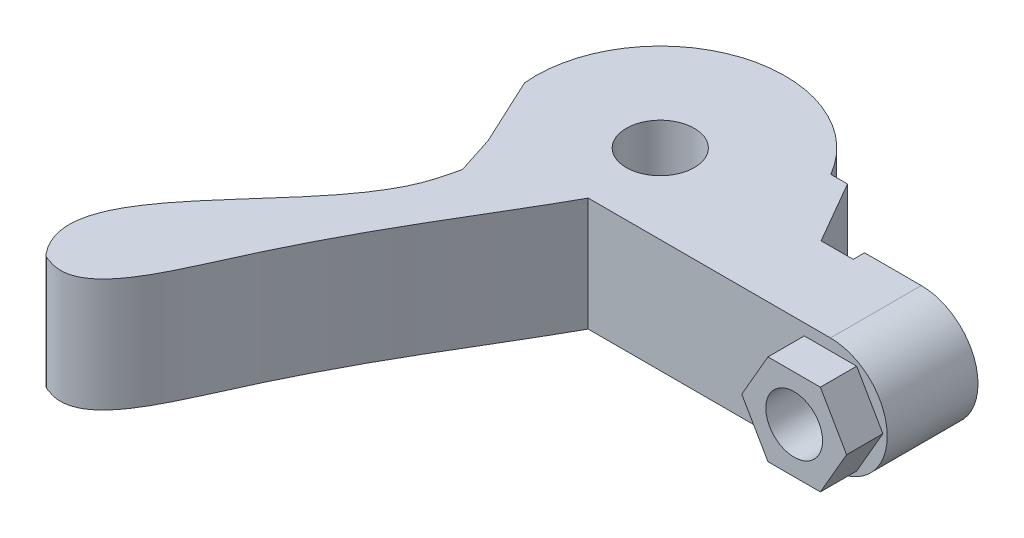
ISO-10303-21;
HEADER;
FILE_DESCRIPTION(('STEP AP214'),'2;1');
FILE_NAME('part.step','',(''),(''),'','','');
FILE_SCHEMA(('AUTOMOTIVE_DESIGN { 1 0 10303 214 1 1 1 1 }'));
ENDSEC;
DATA;
#1=APPLICATION_CONTEXT('core data for automotive mechanical design processes');
#2=APPLICATION_PROTOCOL_DEFINITION('international standard','automotive_design',2000,#1);
#3=PRODUCT_CONTEXT('',#1,'mechanical');
#4=PRODUCT('Part','Part','',(#3));
#5=PRODUCT_RELATED_PRODUCT_CATEGORY('part','',(#4));
#6=PRODUCT_DEFINITION_FORMATION('','',#4);
#7=PRODUCT_DEFINITION_CONTEXT('part definition',#1,'design');
#8=PRODUCT_DEFINITION('design','',#6,#7);
#9=PRODUCT_DEFINITION_SHAPE('','',#8);
#10=(LENGTH_UNIT() NAMED_UNIT(*) SI_UNIT(.MILLI.,.METRE.));
#11=(NAMED_UNIT(*) PLANE_ANGLE_UNIT() SI_UNIT($,.RADIAN.));
#12=(NAMED_UNIT(*) SI_UNIT($,.STERADIAN.) SOLID_ANGLE_UNIT());
#13=UNCERTAINTY_MEASURE_WITH_UNIT(LENGTH_MEASURE(1.E-05),#10,'distance_accuracy_value','');
#14=(GEOMETRIC_REPRESENTATION_CONTEXT(3) GLOBAL_UNCERTAINTY_ASSIGNED_CONTEXT((#13)) GLOBAL_UNIT_ASSIGNED_CONTEXT((#10,
#11,#12)) REPRESENTATION_CONTEXT('',''));
#15=CARTESIAN_POINT('',(0.,0.,0.));
#16=DIRECTION('',(0.,0.,1.));
#17=DIRECTION('',(1.,0.,0.));
#18=AXIS2_PLACEMENT_3D('',#15,#16,#17);
#19=CARTESIAN_POINT('',(24.3094010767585,4.00000000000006,11.));
#20=DIRECTION('',(0.866025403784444,0.499999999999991,0.));
#21=DIRECTION('',(-0.499999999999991,0.866025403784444,0.));
#22=AXIS2_PLACEMENT_3D('',#19,#20,#21);
#23=PLANE('',#22);
#24=DIRECTION('',(0.,0.,-1.));
#25=VECTOR('',#24,1.);
#26=CARTESIAN_POINT('',(24.3094010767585,4.00000000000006,11.));
#27=LINE('',#26,#25);
#28=CARTESIAN_POINT('',(24.3094010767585,4.00000000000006,10.2));
#29=VERTEX_POINT('',#28);
#30=CARTESIAN_POINT('',(24.3094010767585,4.00000000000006,7.));
#31=VERTEX_POINT('',#30);
#32=EDGE_CURVE('E414',#29,#31,#27,.T.);
#33=ORIENTED_EDGE('',*,*,#32,.F.);
#34=DIRECTION('',(-0.499999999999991,0.866025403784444,0.));
#35=VECTOR('',#34,1.);
#36=CARTESIAN_POINT('',(26.618802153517,0.,10.2));
#37=LINE('',#36,#35);
#38=CARTESIAN_POINT('',(26.618802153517,0.,10.2));
#39=VERTEX_POINT('',#38);
#40=EDGE_CURVE('E372',#39,#29,#37,.T.);
#41=ORIENTED_EDGE('',*,*,#40,.F.);
#42=DIRECTION('',(0.,0.,-1.));
#43=VECTOR('',#42,1.);
#44=CARTESIAN_POINT('',(26.618802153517,0.,11.));
#45=LINE('',#44,#43);
#46=CARTESIAN_POINT('',(26.618802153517,0.,7.));
#47=VERTEX_POINT('',#46);
#48=EDGE_CURVE('E405',#39,#47,#45,.T.);
#49=ORIENTED_EDGE('',*,*,#48,.T.);
#50=DIRECTION('',(0.49999999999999,-0.866025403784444,0.));
#51=VECTOR('',#50,1.);
#52=CARTESIAN_POINT('',(24.3094010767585,4.00000000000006,7.));
#53=LINE('',#52,#51);
#54=EDGE_CURVE('E407',#31,#47,#53,.T.);
#55=ORIENTED_EDGE('',*,*,#54,.F.);
#56=EDGE_LOOP('',(#33,#41,#49,#55));
#57=FACE_BOUND('',#56,.T.);
#58=ADVANCED_FACE('F14',(#57),#23,.T.);
#59=CARTESIAN_POINT('',(24.3094010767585,-4.,11.));
#60=DIRECTION('',(-0.86602540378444,0.5,0.));
#61=DIRECTION('',(-0.5,-0.86602540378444,0.));
#62=AXIS2_PLACEMENT_3D('',#59,#60,#61);
#63=PLANE('',#62);
#64=DIRECTION('',(0.5,0.866025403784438,0.));
#65=VECTOR('',#64,1.);
#66=CARTESIAN_POINT('',(24.3094010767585,-4.,10.2));
#67=LINE('',#66,#65);
#68=CARTESIAN_POINT('',(24.3094010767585,-4.,10.2));
#69=VERTEX_POINT('',#68);
#70=EDGE_CURVE('E33',#69,#39,#67,.T.);
#71=ORIENTED_EDGE('',*,*,#70,.F.);
#72=DIRECTION('',(0.,0.,-1.));
#73=VECTOR('',#72,1.);
#74=CARTESIAN_POINT('',(24.3094010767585,-4.,11.));
#75=LINE('',#74,#73);
#76=CARTESIAN_POINT('',(24.3094010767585,-4.,7.));
#77=VERTEX_POINT('',#76);
#78=EDGE_CURVE('E406',#69,#77,#75,.T.);
#79=ORIENTED_EDGE('',*,*,#78,.T.);
#80=DIRECTION('',(0.5,0.86602540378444,0.));
#81=VECTOR('',#80,1.);
#82=CARTESIAN_POINT('',(24.3094010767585,-4.,7.));
#83=LINE('',#82,#81);
#84=EDGE_CURVE('E402',#77,#47,#83,.T.);
#85=ORIENTED_EDGE('',*,*,#84,.T.);
#86=ORIENTED_EDGE('',*,*,#48,.F.);
#87=EDGE_LOOP('',(#71,#79,#85,#86));
#88=FACE_BOUND('',#87,.T.);
#89=ADVANCED_FACE('F218',(#88),#63,.F.);
#90=CARTESIAN_POINT('',(19.6905989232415,-4.,11.));
#91=DIRECTION('',(0.,1.,0.));
#92=DIRECTION('',(-1.,0.,0.));
#93=AXIS2_PLACEMENT_3D('',#90,#91,#92);
#94=PLANE('',#93);
#95=DIRECTION('',(1.,0.,0.));
#96=VECTOR('',#95,1.);
#97=CARTESIAN_POINT('',(19.6905989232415,-4.,10.2));
#98=LINE('',#97,#96);
#99=CARTESIAN_POINT('',(19.6905989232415,-4.,10.2));
#100=VERTEX_POINT('',#99);
#101=EDGE_CURVE('E438',#100,#69,#98,.T.);
#102=ORIENTED_EDGE('',*,*,#101,.F.);
#103=DIRECTION('',(0.,0.,-1.));
#104=VECTOR('',#103,1.);
#105=CARTESIAN_POINT('',(19.6905989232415,-4.,11.));
#106=LINE('',#105,#104);
#107=CARTESIAN_POINT('',(19.6905989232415,-4.,7.));
#108=VERTEX_POINT('',#107);
#109=EDGE_CURVE('E416',#100,#108,#106,.T.);
#110=ORIENTED_EDGE('',*,*,#109,.T.);
#111=DIRECTION('',(1.,0.,0.));
#112=VECTOR('',#111,1.);
#113=CARTESIAN_POINT('',(19.6905989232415,-4.,7.));
#114=LINE('',#113,#112);
#115=EDGE_CURVE('E397',#108,#77,#114,.T.);
#116=ORIENTED_EDGE('',*,*,#115,.T.);
#117=ORIENTED_EDGE('',*,*,#78,.F.);
#118=EDGE_LOOP('',(#102,#110,#116,#117));
#119=FACE_BOUND('',#118,.T.);
#120=ADVANCED_FACE('F225',(#119),#94,.F.);
#121=CARTESIAN_POINT('',(19.6905989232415,-4.,11.));
#122=DIRECTION('',(-0.86602540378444,-0.5,0.));
#123=DIRECTION('',(0.5,-0.86602540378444,0.));
#124=AXIS2_PLACEMENT_3D('',#121,#122,#123);
#125=PLANE('',#124);
#126=ORIENTED_EDGE('',*,*,#109,.F.);
#127=DIRECTION('',(0.5,-0.866025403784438,0.));
#128=VECTOR('',#127,1.);
#129=CARTESIAN_POINT('',(17.381197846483,0.,10.2));
#130=LINE('',#129,#128);
#131=CARTESIAN_POINT('',(17.381197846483,0.,10.2));
#132=VERTEX_POINT('',#131);
#133=EDGE_CURVE('E428',#132,#100,#130,.T.);
#134=ORIENTED_EDGE('',*,*,#133,.F.);
#135=DIRECTION('',(0.,0.,-1.));
#136=VECTOR('',#135,1.);
#137=CARTESIAN_POINT('',(17.381197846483,0.,11.));
#138=LINE('',#137,#136);
#139=CARTESIAN_POINT('',(17.381197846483,0.,7.));
#140=VERTEX_POINT('',#139);
#141=EDGE_CURVE('E24',#132,#140,#138,.T.);
#142=ORIENTED_EDGE('',*,*,#141,.T.);
#143=DIRECTION('',(-0.5,0.86602540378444,0.));
#144=VECTOR('',#143,1.);
#145=CARTESIAN_POINT('',(19.6905989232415,-4.,7.));
#146=LINE('',#145,#144);
#147=EDGE_CURVE('E427',#108,#140,#146,.T.);
#148=ORIENTED_EDGE('',*,*,#147,.F.);
#149=EDGE_LOOP('',(#126,#134,#142,#148));
#150=FACE_BOUND('',#149,.T.);
#151=ADVANCED_FACE('F234',(#150),#125,.T.);
#152=CARTESIAN_POINT('',(19.6905989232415,4.00000000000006,11.));
#153=DIRECTION('',(0.,1.,0.));
#154=DIRECTION('',(0.,0.,1.));
#155=AXIS2_PLACEMENT_3D('',#152,#153,#154);
#156=PLANE('',#155);
#157=DIRECTION('',(0.,0.,-1.));
#158=VECTOR('',#157,1.);
#159=CARTESIAN_POINT('',(19.6905989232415,4.00000000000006,11.));
#160=LINE('',#159,#158);
#161=CARTESIAN_POINT('',(19.6905989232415,4.00000000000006,10.2));
#162=VERTEX_POINT('',#161);
#163=CARTESIAN_POINT('',(19.6905989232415,4.00000000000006,7.));
#164=VERTEX_POINT('',#163);
#165=EDGE_CURVE('E9',#162,#164,#160,.T.);
#166=ORIENTED_EDGE('',*,*,#165,.F.);
#167=DIRECTION('',(-1.,0.,0.));
#168=VECTOR('',#167,1.);
#169=CARTESIAN_POINT('',(24.3094010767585,4.00000000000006,10.2));
#170=LINE('',#169,#168);
#171=EDGE_CURVE('E442',#29,#162,#170,.T.);
#172=ORIENTED_EDGE('',*,*,#171,.F.);
#173=ORIENTED_EDGE('',*,*,#32,.T.);
#174=DIRECTION('',(1.,0.,0.));
#175=VECTOR('',#174,1.);
#176=CARTESIAN_POINT('',(19.6905989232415,4.00000000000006,7.));
#177=LINE('',#176,#175);
#178=EDGE_CURVE('E411',#164,#31,#177,.T.);
#179=ORIENTED_EDGE('',*,*,#178,.F.);
#180=EDGE_LOOP('',(#166,#172,#173,#179));
#181=FACE_BOUND('',#180,.T.);
#182=ADVANCED_FACE('F230',(#181),#156,.T.);
#183=CARTESIAN_POINT('',(24.3094010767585,4.00000000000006,10.2));
#184=DIRECTION('',(0.,0.,1.));
#185=DIRECTION('',(1.,0.,0.));
#186=AXIS2_PLACEMENT_3D('',#183,#184,#185);
#187=PLANE('',#186);
#188=CARTESIAN_POINT('',(22.,0.,10.2));
#189=DIRECTION('',(0.,0.,1.));
#190=DIRECTION('',(1.,0.,0.));
#191=AXIS2_PLACEMENT_3D('',#188,#189,#190);
#192=CIRCLE('',#191,2.5);
#193=CARTESIAN_POINT('',(24.5,0.,10.2));
#194=VERTEX_POINT('',#193);
#195=EDGE_CURVE('E159',#194,#194,#192,.T.);
#196=ORIENTED_EDGE('',*,*,#195,.F.);
#197=EDGE_LOOP('',(#196));
#198=FACE_BOUND('',#197,.T.);
#199=ORIENTED_EDGE('',*,*,#40,.T.);
#200=ORIENTED_EDGE('',*,*,#171,.T.);
#201=DIRECTION('',(-0.499999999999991,-0.866025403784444,0.));
#202=VECTOR('',#201,1.);
#203=CARTESIAN_POINT('',(19.6905989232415,4.00000000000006,10.2));
#204=LINE('',#203,#202);
#205=EDGE_CURVE('E430',#162,#132,#204,.T.);
#206=ORIENTED_EDGE('',*,*,#205,.T.);
#207=ORIENTED_EDGE('',*,*,#133,.T.);
#208=ORIENTED_EDGE('',*,*,#101,.T.);
#209=ORIENTED_EDGE('',*,*,#70,.T.);
#210=EDGE_LOOP('',(#199,#200,#206,#207,#208,#209));
#211=FACE_BOUND('',#210,.T.);
#212=ADVANCED_FACE('F241',(#198,#211),#187,.T.);
#213=CARTESIAN_POINT('',(19.6905989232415,4.00000000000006,11.));
#214=DIRECTION('',(0.866025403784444,-0.499999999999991,0.));
#215=DIRECTION('',(0.499999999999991,0.866025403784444,0.));
#216=AXIS2_PLACEMENT_3D('',#213,#214,#215);
#217=PLANE('',#216);
#218=ORIENTED_EDGE('',*,*,#205,.F.);
#219=ORIENTED_EDGE('',*,*,#165,.T.);
#220=DIRECTION('',(-0.49999999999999,-0.866025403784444,0.));
#221=VECTOR('',#220,1.);
#222=CARTESIAN_POINT('',(19.6905989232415,4.00000000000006,7.));
#223=LINE('',#222,#221);
#224=EDGE_CURVE('E432',#164,#140,#223,.T.);
#225=ORIENTED_EDGE('',*,*,#224,.T.);
#226=ORIENTED_EDGE('',*,*,#141,.F.);
#227=EDGE_LOOP('',(#218,#219,#225,#226));
#228=FACE_BOUND('',#227,.T.);
#229=ADVANCED_FACE('F212',(#228),#217,.F.);
#230=CARTESIAN_POINT('',(22.,0.,11.));
#231=DIRECTION('',(0.,0.,-1.));
#232=DIRECTION('',(-1.,0.,0.));
#233=AXIS2_PLACEMENT_3D('',#230,#231,#232);
#234=CYLINDRICAL_SURFACE('',#233,2.5);
#235=ORIENTED_EDGE('',*,*,#195,.T.);
#236=EDGE_LOOP('',(#235));
#237=FACE_BOUND('',#236,.T.);
#238=CARTESIAN_POINT('',(22.,0.,-1.));
#239=DIRECTION('',(0.,0.,1.));
#240=DIRECTION('',(1.,0.,0.));
#241=AXIS2_PLACEMENT_3D('',#238,#239,#240);
#242=CIRCLE('',#241,2.5);
#243=CARTESIAN_POINT('',(24.5,0.,-1.));
#244=VERTEX_POINT('',#243);
#245=EDGE_CURVE('E18',#244,#244,#242,.T.);
#246=ORIENTED_EDGE('',*,*,#245,.F.);
#247=EDGE_LOOP('',(#246));
#248=FACE_BOUND('',#247,.T.);
#249=ADVANCED_FACE('F205',(#237,#248),#234,.F.);
#250=CARTESIAN_POINT('',(17.,5.,-1.));
#251=DIRECTION('',(0.,0.,1.));
#252=DIRECTION('',(1.,0.,0.));
#253=AXIS2_PLACEMENT_3D('',#250,#251,#252);
#254=PLANE('',#253);
#255=ORIENTED_EDGE('',*,*,#245,.T.);
#256=EDGE_LOOP('',(#255));
#257=FACE_BOUND('',#256,.T.);
#258=DIRECTION('',(-1.,0.,0.));
#259=VECTOR('',#258,1.);
#260=CARTESIAN_POINT('',(17.,5.,-1.));
#261=LINE('',#260,#259);
#262=CARTESIAN_POINT('',(22.,5.,-1.));
#263=VERTEX_POINT('',#262);
#264=CARTESIAN_POINT('',(17.,5.,-1.));
#265=VERTEX_POINT('',#264);
#266=EDGE_CURVE('E140',#263,#265,#261,.T.);
#267=ORIENTED_EDGE('',*,*,#266,.F.);
#268=CARTESIAN_POINT('',(22.,0.,-1.));
#269=DIRECTION('',(0.,0.,1.));
#270=DIRECTION('',(1.,0.,0.));
#271=AXIS2_PLACEMENT_3D('',#268,#269,#270);
#272=CIRCLE('',#271,5.);
#273=CARTESIAN_POINT('',(22.,-5.,-1.));
#274=VERTEX_POINT('',#273);
#275=EDGE_CURVE('E319',#263,#274,#272,.F.);
#276=ORIENTED_EDGE('',*,*,#275,.T.);
#277=DIRECTION('',(-1.,0.,0.));
#278=VECTOR('',#277,1.);
#279=CARTESIAN_POINT('',(17.,-5.,-1.));
#280=LINE('',#279,#278);
#281=CARTESIAN_POINT('',(17.,-5.,-1.));
#282=VERTEX_POINT('',#281);
#283=EDGE_CURVE('E337',#274,#282,#280,.T.);
#284=ORIENTED_EDGE('',*,*,#283,.T.);
#285=DIRECTION('',(0.,-1.,0.));
#286=VECTOR('',#285,1.);
#287=CARTESIAN_POINT('',(17.,5.,-1.));
#288=LINE('',#287,#286);
#289=EDGE_CURVE('E154',#265,#282,#288,.T.);
#290=ORIENTED_EDGE('',*,*,#289,.F.);
#291=EDGE_LOOP('',(#267,#276,#284,#290));
#292=FACE_BOUND('',#291,.T.);
#293=ADVANCED_FACE('F181',(#257,#292),#254,.F.);
#294=CARTESIAN_POINT('',(17.,5.,0.));
#295=DIRECTION('',(1.,0.,0.));
#296=DIRECTION('',(0.,1.,0.));
#297=AXIS2_PLACEMENT_3D('',#294,#295,#296);
#298=PLANE('',#297);
#299=DIRECTION('',(0.,0.,1.));
#300=VECTOR('',#299,1.);
#301=CARTESIAN_POINT('',(17.,-5.,0.));
#302=LINE('',#301,#300);
#303=CARTESIAN_POINT('',(17.,-5.,0.));
#304=VERTEX_POINT('',#303);
#305=EDGE_CURVE('E339',#282,#304,#302,.T.);
#306=ORIENTED_EDGE('',*,*,#305,.T.);
#307=DIRECTION('',(0.,-1.,0.));
#308=VECTOR('',#307,1.);
#309=CARTESIAN_POINT('',(17.,5.,0.));
#310=LINE('',#309,#308);
#311=CARTESIAN_POINT('',(17.,5.,0.));
#312=VERTEX_POINT('',#311);
#313=EDGE_CURVE('E151',#312,#304,#310,.T.);
#314=ORIENTED_EDGE('',*,*,#313,.F.);
#315=DIRECTION('',(0.,0.,1.));
#316=VECTOR('',#315,1.);
#317=CARTESIAN_POINT('',(17.,5.,0.));
#318=LINE('',#317,#316);
#319=EDGE_CURVE('E324',#265,#312,#318,.T.);
#320=ORIENTED_EDGE('',*,*,#319,.F.);
#321=ORIENTED_EDGE('',*,*,#289,.T.);
#322=EDGE_LOOP('',(#306,#314,#320,#321));
#323=FACE_BOUND('',#322,.T.);
#324=ADVANCED_FACE('F200',(#323),#298,.F.);
#325=CARTESIAN_POINT('',(14.175426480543,5.,0.));
#326=DIRECTION('',(0.,0.,1.));
#327=DIRECTION('',(1.,0.,0.));
#328=AXIS2_PLACEMENT_3D('',#325,#326,#327);
#329=PLANE('',#328);
#330=DIRECTION('',(-1.,0.,0.));
#331=VECTOR('',#330,1.);
#332=CARTESIAN_POINT('',(14.175426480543,-5.,0.));
#333=LINE('',#332,#331);
#334=CARTESIAN_POINT('',(14.175426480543,-5.,0.));
#335=VERTEX_POINT('',#334);
#336=EDGE_CURVE('E341',#304,#335,#333,.T.);
#337=ORIENTED_EDGE('',*,*,#336,.T.);
#338=DIRECTION('',(0.,-1.,0.));
#339=VECTOR('',#338,1.);
#340=CARTESIAN_POINT('',(14.175426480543,5.,0.));
#341=LINE('',#340,#339);
#342=CARTESIAN_POINT('',(14.175426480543,5.,0.));
#343=VERTEX_POINT('',#342);
#344=EDGE_CURVE('E148',#343,#335,#341,.T.);
#345=ORIENTED_EDGE('',*,*,#344,.F.);
#346=DIRECTION('',(-1.,0.,0.));
#347=VECTOR('',#346,1.);
#348=CARTESIAN_POINT('',(14.175426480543,5.,0.));
#349=LINE('',#348,#347);
#350=EDGE_CURVE('E326',#312,#343,#349,.T.);
#351=ORIENTED_EDGE('',*,*,#350,.F.);
#352=ORIENTED_EDGE('',*,*,#313,.T.);
#353=EDGE_LOOP('',(#337,#345,#351,#352));
#354=FACE_BOUND('',#353,.T.);
#355=ADVANCED_FACE('F196',(#354),#329,.F.);
#356=CARTESIAN_POINT('',(11.,5.,-5.5));
#357=DIRECTION('',(-0.866025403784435,0.,0.500000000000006));
#358=DIRECTION('',(0.500000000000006,0.,0.866025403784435));
#359=AXIS2_PLACEMENT_3D('',#356,#357,#358);
#360=PLANE('',#359);
#361=DIRECTION('',(-0.500000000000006,0.,-0.866025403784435));
#362=VECTOR('',#361,1.);
#363=CARTESIAN_POINT('',(11.,-5.,-5.5));
#364=LINE('',#363,#362);
#365=CARTESIAN_POINT('',(11.,-5.,-5.5));
#366=VERTEX_POINT('',#365);
#367=EDGE_CURVE('E343',#335,#366,#364,.T.);
#368=ORIENTED_EDGE('',*,*,#367,.T.);
#369=DIRECTION('',(0.,-1.,0.));
#370=VECTOR('',#369,1.);
#371=CARTESIAN_POINT('',(11.,5.,-5.5));
#372=LINE('',#371,#370);
#373=CARTESIAN_POINT('',(11.,5.,-5.5));
#374=VERTEX_POINT('',#373);
#375=EDGE_CURVE('E145',#374,#366,#372,.T.);
#376=ORIENTED_EDGE('',*,*,#375,.F.);
#377=DIRECTION('',(-0.500000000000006,0.,-0.866025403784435));
#378=VECTOR('',#377,1.);
#379=CARTESIAN_POINT('',(11.,5.,-5.5));
#380=LINE('',#379,#378);
#381=EDGE_CURVE('E328',#343,#374,#380,.T.);
#382=ORIENTED_EDGE('',*,*,#381,.F.);
#383=ORIENTED_EDGE('',*,*,#344,.T.);
#384=EDGE_LOOP('',(#368,#376,#382,#383));
#385=FACE_BOUND('',#384,.T.);
#386=ADVANCED_FACE('F192',(#385),#360,.F.);
#387=CARTESIAN_POINT('',(11.,5.,-5.5));
#388=DIRECTION('',(0.,0.,1.));
#389=DIRECTION('',(0.,1.,0.));
#390=AXIS2_PLACEMENT_3D('',#387,#388,#389);
#391=PLANE('',#390);
#392=DIRECTION('',(-1.,0.,0.));
#393=VECTOR('',#392,1.);
#394=CARTESIAN_POINT('',(11.,-5.,-5.5));
#395=LINE('',#394,#393);
#396=CARTESIAN_POINT('',(9.52627944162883,-5.,-5.5));
#397=VERTEX_POINT('',#396);
#398=EDGE_CURVE('E124',#366,#397,#395,.T.);
#399=ORIENTED_EDGE('',*,*,#398,.T.);
#400=DIRECTION('',(0.,-1.,0.));
#401=VECTOR('',#400,1.);
#402=CARTESIAN_POINT('',(9.52627944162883,5.,-5.5));
#403=LINE('',#402,#401);
#404=CARTESIAN_POINT('',(9.52627944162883,5.,-5.5));
#405=VERTEX_POINT('',#404);
#406=EDGE_CURVE('E119',#405,#397,#403,.T.);
#407=ORIENTED_EDGE('',*,*,#406,.F.);
#408=DIRECTION('',(-1.,0.,0.));
#409=VECTOR('',#408,1.);
#410=CARTESIAN_POINT('',(11.,5.,-5.5));
#411=LINE('',#410,#409);
#412=EDGE_CURVE('E330',#374,#405,#411,.T.);
#413=ORIENTED_EDGE('',*,*,#412,.F.);
#414=ORIENTED_EDGE('',*,*,#375,.T.);
#415=EDGE_LOOP('',(#399,#407,#413,#414));
#416=FACE_BOUND('',#415,.T.);
#417=ADVANCED_FACE('F189',(#416),#391,.F.);
#418=CARTESIAN_POINT('',(0.,5.,0.));
#419=DIRECTION('',(0.,-1.,0.));
#420=DIRECTION('',(1.,0.,0.));
#421=AXIS2_PLACEMENT_3D('',#418,#419,#420);
#422=CYLINDRICAL_SURFACE('',#421,11.);
#423=CARTESIAN_POINT('',(0.,-5.,0.));
#424=DIRECTION('',(0.,1.,0.));
#425=DIRECTION('',(-1.,0.,0.));
#426=AXIS2_PLACEMENT_3D('',#423,#424,#425);
#427=CIRCLE('',#426,11.);
#428=CARTESIAN_POINT('',(-10.9544511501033,-5.,1.));
#429=VERTEX_POINT('',#428);
#430=EDGE_CURVE('E112',#397,#429,#427,.T.);
#431=ORIENTED_EDGE('',*,*,#430,.T.);
#432=DIRECTION('',(0.,-1.,0.));
#433=VECTOR('',#432,1.);
#434=CARTESIAN_POINT('',(-10.9544511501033,5.,1.));
#435=LINE('',#434,#433);
#436=CARTESIAN_POINT('',(-10.9544511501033,5.,1.));
#437=VERTEX_POINT('',#436);
#438=EDGE_CURVE('E116',#437,#429,#435,.T.);
#439=ORIENTED_EDGE('',*,*,#438,.F.);
#440=CARTESIAN_POINT('',(0.,5.,0.));
#441=DIRECTION('',(0.,1.,0.));
#442=DIRECTION('',(-1.,0.,0.));
#443=AXIS2_PLACEMENT_3D('',#440,#441,#442);
#444=CIRCLE('',#443,11.);
#445=EDGE_CURVE('E332',#405,#437,#444,.T.);
#446=ORIENTED_EDGE('',*,*,#445,.F.);
#447=ORIENTED_EDGE('',*,*,#406,.T.);
#448=EDGE_LOOP('',(#431,#439,#446,#447));
#449=FACE_BOUND('',#448,.T.);
#450=ADVANCED_FACE('F114',(#449),#422,.T.);
#451=CARTESIAN_POINT('',(-8.62851915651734,5.,5.9879772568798));
#452=DIRECTION('',(0.906307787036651,0.,-0.422618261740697));
#453=DIRECTION('',(-0.422618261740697,0.,-0.906307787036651));
#454=AXIS2_PLACEMENT_3D('',#451,#452,#453);
#455=PLANE('',#454);
#456=DIRECTION('',(0.422618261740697,0.,0.906307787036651));
#457=VECTOR('',#456,1.);
#458=CARTESIAN_POINT('',(-8.62851915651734,-5.,5.9879772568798));
#459=LINE('',#458,#457);
#460=CARTESIAN_POINT('',(-8.15660520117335,-5.,7.));
#461=VERTEX_POINT('',#460);
#462=EDGE_CURVE('E123',#429,#461,#459,.T.);
#463=ORIENTED_EDGE('',*,*,#462,.T.);
#464=DIRECTION('',(0.,1.,0.));
#465=VECTOR('',#464,1.);
#466=CARTESIAN_POINT('',(-8.15660520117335,-7.02404548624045,7.));
#467=LINE('',#466,#465);
#468=CARTESIAN_POINT('',(-8.15660520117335,5.,7.));
#469=VERTEX_POINT('',#468);
#470=EDGE_CURVE('E279',#461,#469,#467,.T.);
#471=ORIENTED_EDGE('',*,*,#470,.T.);
#472=DIRECTION('',(0.422618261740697,0.,0.906307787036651));
#473=VECTOR('',#472,1.);
#474=CARTESIAN_POINT('',(-8.62851915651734,5.,5.9879772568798));
#475=LINE('',#474,#473);
#476=EDGE_CURVE('E131',#437,#469,#475,.T.);
#477=ORIENTED_EDGE('',*,*,#476,.F.);
#478=ORIENTED_EDGE('',*,*,#438,.T.);
#479=EDGE_LOOP('',(#463,#471,#477,#478));
#480=FACE_BOUND('',#479,.T.);
#481=ADVANCED_FACE('F128',(#480),#455,.F.);
#482=CARTESIAN_POINT('',(-7.07279450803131,5.,10.3502769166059));
#483=DIRECTION('',(0.951453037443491,0.,-0.307793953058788));
#484=DIRECTION('',(-0.307793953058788,0.,-0.951453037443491));
#485=AXIS2_PLACEMENT_3D('',#482,#483,#484);
#486=PLANE('',#485);
#487=DIRECTION('',(0.307793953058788,0.,0.951453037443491));
#488=VECTOR('',#487,1.);
#489=CARTESIAN_POINT('',(-7.07279450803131,-5.,10.3502769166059));
#490=LINE('',#489,#488);
#491=CARTESIAN_POINT('',(-7.07279450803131,-5.,10.3502769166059));
#492=VERTEX_POINT('',#491);
#493=EDGE_CURVE('E137',#461,#492,#490,.T.);
#494=ORIENTED_EDGE('',*,*,#493,.T.);
#495=DIRECTION('',(0.,-1.,0.));
#496=VECTOR('',#495,1.);
#497=CARTESIAN_POINT('',(-7.07279450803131,5.,10.3502769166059));
#498=LINE('',#497,#496);
#499=CARTESIAN_POINT('',(-7.07279450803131,5.,10.3502769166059));
#500=VERTEX_POINT('',#499);
#501=EDGE_CURVE('E605',#500,#492,#498,.T.);
#502=ORIENTED_EDGE('',*,*,#501,.F.);
#503=DIRECTION('',(0.307793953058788,0.,0.951453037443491));
#504=VECTOR('',#503,1.);
#505=CARTESIAN_POINT('',(-7.07279450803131,5.,10.3502769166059));
#506=LINE('',#505,#504);
#507=EDGE_CURVE('E272',#469,#500,#506,.T.);
#508=ORIENTED_EDGE('',*,*,#507,.F.);
#509=ORIENTED_EDGE('',*,*,#470,.F.);
#510=EDGE_LOOP('',(#494,#502,#508,#509));
#511=FACE_BOUND('',#510,.T.);
#512=ADVANCED_FACE('F186',(#511),#486,.F.);
#513=CARTESIAN_POINT('',(0.,5.,0.));
#514=DIRECTION('',(0.,1.,0.));
#515=DIRECTION('',(-1.,0.,0.));
#516=AXIS2_PLACEMENT_3D('',#513,#514,#515);
#517=CYLINDRICAL_SURFACE('',#516,3.);
#518=CARTESIAN_POINT('',(0.,-5.,0.));
#519=DIRECTION('',(0.,1.,0.));
#520=DIRECTION('',(-1.,0.,0.));
#521=AXIS2_PLACEMENT_3D('',#518,#519,#520);
#522=CIRCLE('',#521,3.);
#523=CARTESIAN_POINT('',(-3.,-5.,0.));
#524=VERTEX_POINT('',#523);
#525=EDGE_CURVE('E310',#524,#524,#522,.T.);
#526=ORIENTED_EDGE('',*,*,#525,.F.);
#527=EDGE_LOOP('',(#526));
#528=FACE_BOUND('',#527,.T.);
#529=CARTESIAN_POINT('',(0.,5.,0.));
#530=DIRECTION('',(0.,1.,0.));
#531=DIRECTION('',(-1.,0.,0.));
#532=AXIS2_PLACEMENT_3D('',#529,#530,#531);
#533=CIRCLE('',#532,3.);
#534=CARTESIAN_POINT('',(-3.,5.,0.));
#535=VERTEX_POINT('',#534);
#536=EDGE_CURVE('E307',#535,#535,#533,.T.);
#537=ORIENTED_EDGE('',*,*,#536,.T.);
#538=EDGE_LOOP('',(#537));
#539=FACE_BOUND('',#538,.T.);
#540=ADVANCED_FACE('F245',(#528,#539),#517,.F.);
#541=CARTESIAN_POINT('',(-7.07279450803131,5.,10.3502769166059));
#542=CARTESIAN_POINT('',(-7.08503367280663,5.,10.4048138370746));
#543=CARTESIAN_POINT('',(-7.10950550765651,5.,10.5138587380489));
#544=CARTESIAN_POINT('',(-7.14637614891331,5.,10.6773469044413));
#545=CARTESIAN_POINT('',(-7.20034888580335,5.,10.9142299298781));
#546=CARTESIAN_POINT('',(-7.40497929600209,5.,11.7924302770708));
#547=CARTESIAN_POINT('',(-7.78277260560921,5.,13.1209782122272));
#548=CARTESIAN_POINT('',(-8.85286441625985,5.,15.2999930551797));
#549=CARTESIAN_POINT('',(-10.3789146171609,5.,17.5079967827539));
#550=CARTESIAN_POINT('',(-12.0387280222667,5.,19.5003206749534));
#551=CARTESIAN_POINT('',(-13.1379566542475,5.,20.7575771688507));
#552=CARTESIAN_POINT('',(-14.1578770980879,5.,21.9084929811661));
#553=CARTESIAN_POINT('',(-15.4671257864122,5.,23.3763829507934));
#554=CARTESIAN_POINT('',(-17.3949896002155,5.,25.6446975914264));
#555=CARTESIAN_POINT('',(-18.8433058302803,5.,27.6658326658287));
#556=CARTESIAN_POINT('',(-19.6716183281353,5.,29.3745072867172));
#557=CARTESIAN_POINT('',(-20.1503021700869,5.,30.7733386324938));
#558=CARTESIAN_POINT('',(-20.3247147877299,5.,32.5289564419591));
#559=CARTESIAN_POINT('',(-19.7746743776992,5.,34.0502402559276));
#560=CARTESIAN_POINT('',(-19.0895264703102,5.,35.0244804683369));
#561=CARTESIAN_POINT('',(-18.8645021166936,5.,35.2965920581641));
#562=CARTESIAN_POINT('',(-18.7009738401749,5.,35.3910092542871));
#563=B_SPLINE_CURVE_WITH_KNOTS('',3,(#541,#542,#543,#544,#545,#546,#547,#548,#549,#550,#551,
#552,#553,#554,#555,#556,#557,#558,#559,#560,#561,#562),.UNSPECIFIED.,.F.,.F.,(4,1,1,1,1,1,1,1,
1,1,1,1,1,1,1,1,1,1,1,4),(0.,0.00603689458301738,0.0120705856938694,0.0180978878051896,
0.0322618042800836,0.109314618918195,0.165489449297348,0.275997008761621,0.358953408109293,
0.394074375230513,0.421689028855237,0.493063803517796,0.56667755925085,0.692286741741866,
0.739434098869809,0.779454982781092,0.868431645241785,0.964695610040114,0.979087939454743,
0.999999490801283),.UNSPECIFIED.);
#564=DIRECTION('',(0.,-1.,0.));
#565=VECTOR('',#564,1.);
#566=SURFACE_OF_LINEAR_EXTRUSION('',#563,#565);
#567=CARTESIAN_POINT('',(-7.07279450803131,-5.,10.3502769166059));
#568=CARTESIAN_POINT('',(-7.08503367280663,-5.,10.4048138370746));
#569=CARTESIAN_POINT('',(-7.10950550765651,-5.,10.5138587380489));
#570=CARTESIAN_POINT('',(-7.14637614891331,-5.,10.6773469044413));
#571=CARTESIAN_POINT('',(-7.20034888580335,-5.,10.9142299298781));
#572=CARTESIAN_POINT('',(-7.40497929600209,-5.,11.7924302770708));
#573=CARTESIAN_POINT('',(-7.78277260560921,-5.,13.1209782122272));
#574=CARTESIAN_POINT('',(-8.85286441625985,-5.,15.2999930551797));
#575=CARTESIAN_POINT('',(-10.3789146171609,-5.,17.5079967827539));
#576=CARTESIAN_POINT('',(-12.0387280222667,-5.,19.5003206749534));
#577=CARTESIAN_POINT('',(-13.1379566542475,-5.,20.7575771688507));
#578=CARTESIAN_POINT('',(-14.1578770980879,-5.,21.9084929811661));
#579=CARTESIAN_POINT('',(-15.4671257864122,-5.,23.3763829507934));
#580=CARTESIAN_POINT('',(-17.3949896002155,-5.,25.6446975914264));
#581=CARTESIAN_POINT('',(-18.8433058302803,-5.,27.6658326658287));
#582=CARTESIAN_POINT('',(-19.6716183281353,-5.,29.3745072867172));
#583=CARTESIAN_POINT('',(-20.1503021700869,-5.,30.7733386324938));
#584=CARTESIAN_POINT('',(-20.3247147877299,-5.,32.5289564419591));
#585=CARTESIAN_POINT('',(-19.7746743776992,-5.,34.0502402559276));
#586=CARTESIAN_POINT('',(-19.0895264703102,-5.,35.0244804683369));
#587=CARTESIAN_POINT('',(-18.8645021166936,-5.,35.2965920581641));
#588=CARTESIAN_POINT('',(-18.7009738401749,-5.,35.3910092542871));
#589=B_SPLINE_CURVE_WITH_KNOTS('',3,(#567,#568,#569,#570,#571,#572,#573,#574,#575,#576,#577,
#578,#579,#580,#581,#582,#583,#584,#585,#586,#587,#588),.UNSPECIFIED.,.F.,.F.,(4,1,1,1,1,1,1,1,
1,1,1,1,1,1,1,1,1,1,1,4),(0.,0.00603689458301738,0.0120705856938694,0.0180978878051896,
0.0322618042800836,0.109314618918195,0.165489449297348,0.275997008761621,0.358953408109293,
0.394074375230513,0.421689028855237,0.493063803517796,0.56667755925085,0.692286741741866,
0.739434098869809,0.779454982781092,0.868431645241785,0.964695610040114,0.979087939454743,
0.999999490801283),.UNSPECIFIED.);
#590=CARTESIAN_POINT('',(-18.7009738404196,-5.,35.3910092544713));
#591=VERTEX_POINT('',#590);
#592=EDGE_CURVE('E162',#492,#591,#589,.T.);
#593=ORIENTED_EDGE('',*,*,#592,.T.);
#594=DIRECTION('',(0.,-1.,0.));
#595=VECTOR('',#594,1.);
#596=CARTESIAN_POINT('',(-18.7009738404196,5.,35.3910092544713));
#597=LINE('',#596,#595);
#598=CARTESIAN_POINT('',(-18.7009738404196,5.,35.3910092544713));
#599=VERTEX_POINT('',#598);
#600=EDGE_CURVE('E276',#599,#591,#597,.T.);
#601=ORIENTED_EDGE('',*,*,#600,.F.);
#602=CARTESIAN_POINT('',(-18.7009738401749,5.,35.3910092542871));
#603=CARTESIAN_POINT('',(-18.8645021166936,5.,35.2965920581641));
#604=CARTESIAN_POINT('',(-19.0895264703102,5.,35.0244804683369));
#605=CARTESIAN_POINT('',(-19.7746743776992,5.,34.0502402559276));
#606=CARTESIAN_POINT('',(-20.3247147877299,5.,32.5289564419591));
#607=CARTESIAN_POINT('',(-20.1503021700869,5.,30.7733386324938));
#608=CARTESIAN_POINT('',(-19.6716183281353,5.,29.3745072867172));
#609=CARTESIAN_POINT('',(-18.8433058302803,5.,27.6658326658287));
#610=CARTESIAN_POINT('',(-17.3949896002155,5.,25.6446975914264));
#611=CARTESIAN_POINT('',(-15.4671257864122,5.,23.3763829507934));
#612=CARTESIAN_POINT('',(-14.1578770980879,5.,21.9084929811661));
#613=CARTESIAN_POINT('',(-13.1379566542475,5.,20.7575771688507));
#614=CARTESIAN_POINT('',(-12.0387280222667,5.,19.5003206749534));
#615=CARTESIAN_POINT('',(-10.3789146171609,5.,17.5079967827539));
#616=CARTESIAN_POINT('',(-8.85286441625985,5.,15.2999930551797));
#617=CARTESIAN_POINT('',(-7.78277260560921,5.,13.1209782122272));
#618=CARTESIAN_POINT('',(-7.40497929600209,5.,11.7924302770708));
#619=CARTESIAN_POINT('',(-7.20034888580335,5.,10.9142299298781));
#620=CARTESIAN_POINT('',(-7.14637614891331,5.,10.6773469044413));
#621=CARTESIAN_POINT('',(-7.10950550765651,5.,10.5138587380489));
#622=CARTESIAN_POINT('',(-7.08503367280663,5.,10.4048138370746));
#623=CARTESIAN_POINT('',(-7.07279450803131,5.,10.3502769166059));
#624=B_SPLINE_CURVE_WITH_KNOTS('',3,(#602,#603,#604,#605,#606,#607,#608,#609,#610,#611,#612,
#613,#614,#615,#616,#617,#618,#619,#620,#621,#622,#623),.UNSPECIFIED.,.F.,.F.,(4,1,1,1,1,1,1,1,
1,1,1,1,1,1,1,1,1,1,1,4),(0.,0.02091155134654,0.035303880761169,0.131567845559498,
0.220544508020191,0.260565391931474,0.307712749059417,0.433321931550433,0.506935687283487,
0.578310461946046,0.60592511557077,0.64104608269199,0.724002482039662,0.834510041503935,
0.890684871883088,0.967737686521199,0.981901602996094,0.987928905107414,0.993962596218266,
0.999999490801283),.UNSPECIFIED.);
#625=EDGE_CURVE('E273',#500,#599,#624,.F.);
#626=ORIENTED_EDGE('',*,*,#625,.F.);
#627=ORIENTED_EDGE('',*,*,#501,.T.);
#628=EDGE_LOOP('',(#593,#601,#626,#627));
#629=FACE_BOUND('',#628,.T.);
#630=ADVANCED_FACE('F251',(#629),#566,.F.);
#631=CARTESIAN_POINT('',(5.19615242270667,5.,15.));
#632=DIRECTION('',(0.,1.,0.));
#633=DIRECTION('',(-1.,0.,0.));
#634=AXIS2_PLACEMENT_3D('',#631,#632,#633);
#635=PLANE('',#634);
#636=ORIENTED_EDGE('',*,*,#476,.T.);
#637=ORIENTED_EDGE('',*,*,#507,.T.);
#638=ORIENTED_EDGE('',*,*,#625,.T.);
#639=CARTESIAN_POINT('',(-18.7009738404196,5.,35.3910092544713));
#640=CARTESIAN_POINT('',(-18.4314665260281,5.,35.4904815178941));
#641=CARTESIAN_POINT('',(-18.0127798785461,5.,35.6466293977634));
#642=CARTESIAN_POINT('',(-17.5379929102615,5.,35.7405563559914));
#643=CARTESIAN_POINT('',(-17.2673275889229,5.,35.7662558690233));
#644=CARTESIAN_POINT('',(-17.0936892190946,5.,35.7718373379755));
#645=CARTESIAN_POINT('',(-16.9241988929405,5.,35.7673640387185));
#646=CARTESIAN_POINT('',(-16.7810408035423,5.,35.7558621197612));
#647=CARTESIAN_POINT('',(-16.6372133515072,5.,35.7369977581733));
#648=CARTESIAN_POINT('',(-16.5130691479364,5.,35.7147339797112));
#649=CARTESIAN_POINT('',(-16.3863334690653,5.,35.6861899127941));
#650=CARTESIAN_POINT('',(-16.2755163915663,5.,35.6563417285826));
#651=CARTESIAN_POINT('',(-16.1612177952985,5.,35.6207163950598));
#652=CARTESIAN_POINT('',(-16.060406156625,5.,35.5851549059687));
#653=CARTESIAN_POINT('',(-15.9556769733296,5.,35.5440628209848));
#654=CARTESIAN_POINT('',(-15.8627284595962,5.,35.5040010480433));
#655=CARTESIAN_POINT('',(-15.7656518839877,5.,35.4585272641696));
#656=CARTESIAN_POINT('',(-15.6790885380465,5.,35.4148050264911));
#657=CARTESIAN_POINT('',(-15.5883075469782,5.,35.3657206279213));
#658=CARTESIAN_POINT('',(-15.5070584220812,5.,35.3189480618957));
#659=CARTESIAN_POINT('',(-15.4215702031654,5.,35.2668244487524));
#660=CARTESIAN_POINT('',(-15.3448296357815,5.,35.2174614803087));
#661=CARTESIAN_POINT('',(-15.2638680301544,5.,35.1627361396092));
#662=CARTESIAN_POINT('',(-15.1910117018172,5.,35.1111397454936));
#663=CARTESIAN_POINT('',(-15.1139755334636,5.,35.0541565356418));
#664=CARTESIAN_POINT('',(-15.044541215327,5.,35.0006361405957));
#665=CARTESIAN_POINT('',(-14.9710215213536,5.,34.9417314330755));
#666=CARTESIAN_POINT('',(-14.9046431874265,5.,34.8865549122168));
#667=CARTESIAN_POINT('',(-14.8342057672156,5.,34.8259333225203));
#668=CARTESIAN_POINT('',(-14.7704765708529,5.,34.7692311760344));
#669=CARTESIAN_POINT('',(-14.7027540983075,5.,34.7070456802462));
#670=CARTESIAN_POINT('',(-14.6413991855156,5.,34.6489757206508));
#671=CARTESIAN_POINT('',(-14.5761181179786,5.,34.5853834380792));
#672=CARTESIAN_POINT('',(-14.5169049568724,5.,34.5260792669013));
#673=CARTESIAN_POINT('',(-14.4538325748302,5.,34.4612139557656));
#674=CARTESIAN_POINT('',(-14.396562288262,5.,34.400789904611));
#675=CARTESIAN_POINT('',(-14.3354985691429,5.,34.3347665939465));
#676=CARTESIAN_POINT('',(-14.2799994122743,5.,34.2733214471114));
#677=CARTESIAN_POINT('',(-14.2207708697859,5.,34.2062399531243));
#678=CARTESIAN_POINT('',(-14.166893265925,5.,34.1438597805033));
#679=CARTESIAN_POINT('',(-14.1093482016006,5.,34.07580742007));
#680=CARTESIAN_POINT('',(-14.0569608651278,5.,34.0125677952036));
#681=CARTESIAN_POINT('',(-14.0009656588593,5.,33.9436215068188));
#682=CARTESIAN_POINT('',(-13.9501608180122,5.,33.8798506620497));
#683=CARTESIAN_POINT('',(-13.896060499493,5.,33.8106789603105));
#684=CARTESIAN_POINT('',(-13.8469721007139,5.,33.7467866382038));
#685=CARTESIAN_POINT('',(-13.7944254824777,5.,33.6772053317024));
#686=CARTESIAN_POINT('',(-13.7464858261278,5.,33.6126502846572));
#687=CARTESIAN_POINT('',(-13.6951393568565,5.,33.5423765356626));
#688=CARTESIAN_POINT('',(-13.6482684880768,5.,33.47720484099));
#689=CARTESIAN_POINT('',(-13.5980398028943,5.,33.4062861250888));
#690=CARTESIAN_POINT('',(-13.5521653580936,5.,33.3405394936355));
#691=CARTESIAN_POINT('',(-13.5029797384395,5.,33.2690188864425));
#692=CARTESIAN_POINT('',(-13.458035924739,5.,33.2027352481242));
#693=CARTESIAN_POINT('',(-13.4098252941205,5.,33.1306520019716));
#694=CARTESIAN_POINT('',(-13.3657520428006,5.,33.0638659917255));
#695=CARTESIAN_POINT('',(-13.3184541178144,5.,32.9912560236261));
#696=CARTESIAN_POINT('',(-13.2751963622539,5.,32.9239993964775));
#697=CARTESIAN_POINT('',(-13.2287539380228,5.,32.8508956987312));
#698=CARTESIAN_POINT('',(-13.1862610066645,5.,32.7831976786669));
#699=CARTESIAN_POINT('',(-13.1406213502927,5.,32.7096306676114));
#700=CARTESIAN_POINT('',(-13.0988464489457,5.,32.6415182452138));
#701=CARTESIAN_POINT('',(-13.0539607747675,5.,32.5675160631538));
#702=CARTESIAN_POINT('',(-13.012860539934,5.,32.4990142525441));
#703=CARTESIAN_POINT('',(-12.9686835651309,5.,32.4246030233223));
#704=CARTESIAN_POINT('',(-12.9282176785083,5.,32.3557350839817));
#705=CARTESIAN_POINT('',(-12.8847072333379,5.,32.280939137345));
#706=CARTESIAN_POINT('',(-12.8448380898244,5.,32.2117267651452));
#707=CARTESIAN_POINT('',(-12.8019547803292,5.,32.1365688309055));
#708=CARTESIAN_POINT('',(-12.7626471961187,5.,32.0670323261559));
#709=CARTESIAN_POINT('',(-12.720354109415,5.,31.9915337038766));
#710=CARTESIAN_POINT('',(-12.6815750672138,5.,31.9216921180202));
#711=CARTESIAN_POINT('',(-12.6398375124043,5.,31.8458728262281));
#712=CARTESIAN_POINT('',(-12.6015559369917,5.,31.7757440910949));
#713=CARTESIAN_POINT('',(-12.5603412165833,5.,31.6996229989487));
#714=CARTESIAN_POINT('',(-12.5225277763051,5.,31.629224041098));
#715=CARTESIAN_POINT('',(-12.4818049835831,5.,31.552818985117));
#716=CARTESIAN_POINT('',(-12.4444319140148,5.,31.4821658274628));
#717=CARTESIAN_POINT('',(-12.4041717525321,5.,31.4054937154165));
#718=CARTESIAN_POINT('',(-12.3672126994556,5.,31.3346015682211));
#719=CARTESIAN_POINT('',(-12.3273873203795,5.,31.2576784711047));
#720=CARTESIAN_POINT('',(-12.2796413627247,5.,31.1648285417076));
#721=CARTESIAN_POINT('',(-12.2150986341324,5.,31.0381196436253));
#722=CARTESIAN_POINT('',(-12.1431906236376,5.,30.8951747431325));
#723=CARTESIAN_POINT('',(-12.0659940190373,5.,30.7399118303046));
#724=CARTESIAN_POINT('',(-11.9953475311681,5.,30.5962389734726));
#725=CARTESIAN_POINT('',(-11.9194267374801,5.,30.4402398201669));
#726=CARTESIAN_POINT('',(-11.8498766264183,5.,30.2959342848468));
#727=CARTESIAN_POINT('',(-11.7750586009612,5.,30.1392987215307));
#728=CARTESIAN_POINT('',(-11.7064500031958,5.,29.9944498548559));
#729=CARTESIAN_POINT('',(-11.6325715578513,5.,29.8372720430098));
#730=CARTESIAN_POINT('',(-11.5647575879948,5.,29.691964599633));
#731=CARTESIAN_POINT('',(-11.4916630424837,5.,29.53433437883));
#732=CARTESIAN_POINT('',(-11.424502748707,5.,29.3886496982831));
#733=CARTESIAN_POINT('',(-11.3520418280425,5.,29.2306537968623));
#734=CARTESIAN_POINT('',(-11.2853983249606,5.,29.0846708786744));
#735=CARTESIAN_POINT('',(-11.2134241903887,5.,28.9263940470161));
#736=CARTESIAN_POINT('',(-11.1471629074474,5.,28.780190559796));
#737=CARTESIAN_POINT('',(-11.0755303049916,5.,28.6217166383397));
#738=CARTESIAN_POINT('',(-11.009517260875,5.,28.475369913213));
#739=CARTESIAN_POINT('',(-10.9380806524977,5.,28.3167829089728));
#740=CARTESIAN_POINT('',(-10.8621126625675,5.,28.1480024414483));
#741=CARTESIAN_POINT('',(-10.7678454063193,5.,27.9385508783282));
#742=CARTESIAN_POINT('',(-10.6689035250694,5.,27.7189886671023));
#743=CARTESIAN_POINT('',(-10.5614656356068,5.,27.4812746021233));
#744=CARTESIAN_POINT('',(-10.4619311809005,5.,27.2620518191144));
#745=CARTESIAN_POINT('',(-10.3536403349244,5.,27.0248246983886));
#746=CARTESIAN_POINT('',(-10.2532652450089,5.,26.8060851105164));
#747=CARTESIAN_POINT('',(-10.14406906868,5.,26.5693807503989));
#748=CARTESIAN_POINT('',(-10.0428495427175,5.,26.3511286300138));
#749=CARTESIAN_POINT('',(-9.93273289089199,5.,26.1149556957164));
#750=CARTESIAN_POINT('',(-9.83065767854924,5.,25.8971975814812));
#751=CARTESIAN_POINT('',(-9.71960801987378,5.,25.6615632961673));
#752=CARTESIAN_POINT('',(-9.61399553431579,5.,25.4386692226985));
#753=CARTESIAN_POINT('',(-9.51769602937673,5.,25.2365657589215));
#754=CARTESIAN_POINT('',(-9.4395364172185,5.,25.0732247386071));
#755=CARTESIAN_POINT('',(-9.38416116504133,5.,24.9578797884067));
#756=CARTESIAN_POINT('',(-9.33600523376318,5.,24.8578241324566));
#757=CARTESIAN_POINT('',(-9.29826041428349,5.,24.7795538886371));
#758=CARTESIAN_POINT('',(-9.25730732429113,5.,24.6947974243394));
#759=CARTESIAN_POINT('',(-9.21944635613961,5.,24.6165942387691));
#760=CARTESIAN_POINT('',(-9.17836723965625,5.,24.5319105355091));
#761=CARTESIAN_POINT('',(-9.14038976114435,5.,24.4537746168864));
#762=CARTESIAN_POINT('',(-9.09918423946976,5.,24.3691638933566));
#763=CARTESIAN_POINT('',(-9.06188692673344,5.,24.2927287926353));
#764=CARTESIAN_POINT('',(-9.02237068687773,5.,24.2119008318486));
#765=CARTESIAN_POINT('',(-8.98678113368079,5.,24.1392380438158));
#766=CARTESIAN_POINT('',(-8.94817062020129,5.,24.0605518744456));
#767=CARTESIAN_POINT('',(-8.91247917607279,5.,23.987947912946));
#768=CARTESIAN_POINT('',(-8.87375816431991,5.,23.9093255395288));
#769=CARTESIAN_POINT('',(-8.83796461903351,5.,23.8367805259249));
#770=CARTESIAN_POINT('',(-8.79913289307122,5.,23.7582220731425));
#771=CARTESIAN_POINT('',(-8.76323705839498,5.,23.6857361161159));
#772=CARTESIAN_POINT('',(-8.72429442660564,5.,23.6072416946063));
#773=CARTESIAN_POINT('',(-8.6882961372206,5.,23.5348148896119));
#774=CARTESIAN_POINT('',(-8.64924243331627,5.,23.4563845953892));
#775=CARTESIAN_POINT('',(-8.61314154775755,5.,23.3840170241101));
#776=CARTESIAN_POINT('',(-8.57397663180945,5.,23.3056509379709));
#777=CARTESIAN_POINT('',(-8.53777303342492,5.,23.2333426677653));
#778=CARTESIAN_POINT('',(-8.49849679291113,5.,23.1550408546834));
#779=CARTESIAN_POINT('',(-8.46219039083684,5.,23.0827919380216));
#780=CARTESIAN_POINT('',(-8.42280274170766,5.,23.0045544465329));
#781=CARTESIAN_POINT('',(-8.38639347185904,5.,22.9323649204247));
#782=CARTESIAN_POINT('',(-8.34689435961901,5.,22.8541917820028));
#783=CARTESIAN_POINT('',(-8.31038218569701,5.,22.7820616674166));
#784=CARTESIAN_POINT('',(-8.27077158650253,5.,22.703952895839));
#785=CARTESIAN_POINT('',(-8.23415650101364,5.,22.6318821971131));
#786=CARTESIAN_POINT('',(-8.19443442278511,5.,22.553837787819));
#787=CARTESIAN_POINT('',(-8.15771644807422,5.,22.4818264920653));
#788=CARTESIAN_POINT('',(-8.11788293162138,5.,22.403846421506));
#789=CARTESIAN_POINT('',(-8.08106212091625,5.,22.3318944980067));
#790=CARTESIAN_POINT('',(-8.04111724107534,5.,22.2539787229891));
#791=CARTESIAN_POINT('',(-8.00419367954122,5.,22.1820861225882));
#792=CARTESIAN_POINT('',(-7.96413754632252,5.,22.1042345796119));
#793=CARTESIAN_POINT('',(-7.92711135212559,5.,22.0324012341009));
#794=CARTESIAN_POINT('',(-7.8869441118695,5.,21.9546138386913));
#795=CARTESIAN_POINT('',(-7.84981543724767,5.,21.8828396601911));
#796=CARTESIAN_POINT('',(-7.80953727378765,5.,21.8051163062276));
#797=CARTESIAN_POINT('',(-7.77230630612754,5.,21.733401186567));
#798=CARTESIAN_POINT('',(-7.73191744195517,5.,21.6557417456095));
#799=CARTESIAN_POINT('',(-7.69458440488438,5.,21.5840855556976));
#800=CARTESIAN_POINT('',(-7.65408510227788,5.,21.506489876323));
#801=CARTESIAN_POINT('',(-7.61665025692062,5.,21.4348924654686));
#802=CARTESIAN_POINT('',(-7.57604081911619,5.,21.3573603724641));
#803=CARTESIAN_POINT('',(-7.52703538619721,5.,21.2639631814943));
#804=CARTESIAN_POINT('',(-7.46017508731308,5.,21.136859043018));
#805=CARTESIAN_POINT('',(-7.38475468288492,5.,20.9939820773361));
#806=CARTESIAN_POINT('',(-7.3028315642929,5.,20.8393243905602));
#807=CARTESIAN_POINT('',(-7.22701007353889,5.,20.6966789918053));
#808=CARTESIAN_POINT('',(-7.14465450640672,5.,20.5422709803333));
#809=CARTESIAN_POINT('',(-7.06843589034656,5.,20.399854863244));
#810=CARTESIAN_POINT('',(-6.98565255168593,5.,20.2456938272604));
#811=CARTESIAN_POINT('',(-6.9090414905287,5.,20.1035042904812));
#812=CARTESIAN_POINT('',(-6.8258358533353,5.,19.9495870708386));
#813=CARTESIAN_POINT('',(-6.74883777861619,5.,19.8076209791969));
#814=CARTESIAN_POINT('',(-6.66521614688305,5.,19.6539439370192));
#815=CARTESIAN_POINT('',(-6.58783727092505,5.,19.5121977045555));
#816=CARTESIAN_POINT('',(-6.50380681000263,5.,19.358756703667));
#817=CARTESIAN_POINT('',(-6.42605415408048,5.,19.2172262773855));
#818=CARTESIAN_POINT('',(-6.34162292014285,5.,19.0640166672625));
#819=CARTESIAN_POINT('',(-6.26350434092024,5.,18.9226975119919));
#820=CARTESIAN_POINT('',(-6.17868130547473,5.,18.7697141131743));
#821=CARTESIAN_POINT('',(-6.0882163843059,5.,18.6070426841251));
#822=CARTESIAN_POINT('',(-5.9756474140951,5.,18.4053495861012));
#823=CARTESIAN_POINT('',(-5.85722748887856,5.,18.1940877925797));
#824=CARTESIAN_POINT('',(-5.72853207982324,5.,17.9654559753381));
#825=CARTESIAN_POINT('',(-5.60936897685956,5.,17.7546232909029));
#826=CARTESIAN_POINT('',(-5.47989013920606,5.,17.5264438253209));
#827=CARTESIAN_POINT('',(-5.3600248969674,5.,17.3160165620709));
#828=CARTESIAN_POINT('',(-5.22980957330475,5.,17.0882623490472));
#829=CARTESIAN_POINT('',(-5.10838935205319,5.,16.8766483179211));
#830=CARTESIAN_POINT('',(-4.97543857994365,5.,16.6457357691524));
#831=CARTESIAN_POINT('',(-4.87662308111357,5.,16.474684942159));
#832=CARTESIAN_POINT('',(-4.79950946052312,5.,16.341499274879));
#833=CARTESIAN_POINT('',(-4.75804294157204,5.,16.2699554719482));
#834=CARTESIAN_POINT('',(-4.71308654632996,5.,16.1924695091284));
#835=CARTESIAN_POINT('',(-4.67155714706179,5.,16.1209620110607));
#836=CARTESIAN_POINT('',(-4.62653388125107,5.,16.04351465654));
#837=CARTESIAN_POINT('',(-4.58494392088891,5.,15.9720421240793));
#838=CARTESIAN_POINT('',(-4.53985632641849,5.,15.8946319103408));
#839=CARTESIAN_POINT('',(-4.49820817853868,5.,15.823192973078));
#840=CARTESIAN_POINT('',(-4.45305885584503,5.,15.7458183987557));
#841=CARTESIAN_POINT('',(-4.41135494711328,5.,15.6744116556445));
#842=CARTESIAN_POINT('',(-4.36614655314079,5.,15.5970711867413));
#843=CARTESIAN_POINT('',(-4.324389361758,5.,15.5256952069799));
#844=CARTESIAN_POINT('',(-4.27912460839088,5.,15.4483872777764));
#845=CARTESIAN_POINT('',(-4.23731666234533,5.,15.3770406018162));
#846=CARTESIAN_POINT('',(-4.19199831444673,5.,15.2997636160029));
#847=CARTESIAN_POINT('',(-4.1501421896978,5.,15.2284447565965));
#848=CARTESIAN_POINT('',(-4.10477306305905,5.,15.151197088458));
#849=CARTESIAN_POINT('',(-4.06287138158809,5.,15.0799045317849));
#850=CARTESIAN_POINT('',(-4.01745434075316,5.,15.0026845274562));
#851=CARTESIAN_POINT('',(-3.97550976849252,5.,14.9314167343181));
#852=CARTESIAN_POINT('',(-3.93004772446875,5.,14.8542227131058));
#853=CARTESIAN_POINT('',(-3.8880629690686,5.,14.7829781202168));
#854=CARTESIAN_POINT('',(-3.84255887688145,5.,14.7058083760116));
#855=CARTESIAN_POINT('',(-3.80053668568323,5.,14.6345853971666));
#856=CARTESIAN_POINT('',(-3.75499354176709,5.,14.5574381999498));
#857=CARTESIAN_POINT('',(-3.71293669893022,5.,14.4862352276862));
#858=CARTESIAN_POINT('',(-3.6673575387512,5.,14.4091088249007));
#859=CARTESIAN_POINT('',(-3.62526886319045,5.,14.3379242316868));
#860=CARTESIAN_POINT('',(-3.57965675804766,5.,14.2608168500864));
#861=CARTESIAN_POINT('',(-3.53753910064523,5.,14.1896489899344));
#862=CARTESIAN_POINT('',(-3.49189715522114,5.,14.1125588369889));
#863=CARTESIAN_POINT('',(-3.43687611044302,5.,14.0196648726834));
#864=CARTESIAN_POINT('',(-3.36192332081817,5.,13.8931885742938));
#865=CARTESIAN_POINT('',(-3.27755895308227,5.,13.7509273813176));
#866=CARTESIAN_POINT('',(-3.18612529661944,5.,13.5968335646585));
#867=CARTESIAN_POINT('',(-3.1016942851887,5.,13.4546108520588));
#868=CARTESIAN_POINT('',(-3.01020131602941,5.,13.3005512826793));
#869=CARTESIAN_POINT('',(-2.92572749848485,5.,13.1583532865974));
#870=CARTESIAN_POINT('',(-2.85610490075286,5.,13.0411773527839));
#871=CARTESIAN_POINT('',(-2.80838364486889,5.,12.9608671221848));
#872=CARTESIAN_POINT('',(-1.62405144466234,5.,10.9678044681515));
#873=CARTESIAN_POINT('',(-0.450049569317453,5.,8.9935389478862));
#874=CARTESIAN_POINT('',(0.648784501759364,5.,6.99999999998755));
#875=B_SPLINE_CURVE_WITH_KNOTS('',3,(#639,#640,#641,#642,#643,#644,#645,#646,#647,#648,#649,
#650,#651,#652,#653,#654,#655,#656,#657,#658,#659,#660,#661,#662,#663,#664,#665,#666,#667,#668,
#669,#670,#671,#672,#673,#674,#675,#676,#677,#678,#679,#680,#681,#682,#683,#684,#685,#686,#687,
#688,#689,#690,#691,#692,#693,#694,#695,#696,#697,#698,#699,#700,#701,#702,#703,#704,#705,#706,
#707,#708,#709,#710,#711,#712,#713,#714,#715,#716,#717,#718,#719,#720,#721,#722,#723,#724,#725,
#726,#727,#728,#729,#730,#731,#732,#733,#734,#735,#736,#737,#738,#739,#740,#741,#742,#743,#744,
#745,#746,#747,#748,#749,#750,#751,#752,#753,#754,#755,#756,#757,#758,#759,#760,#761,#762,#763,
#764,#765,#766,#767,#768,#769,#770,#771,#772,#773,#774,#775,#776,#777,#778,#779,#780,#781,#782,
#783,#784,#785,#786,#787,#788,#789,#790,#791,#792,#793,#794,#795,#796,#797,#798,#799,#800,#801,
#802,#803,#804,#805,#806,#807,#808,#809,#810,#811,#812,#813,#814,#815,#816,#817,#818,#819,#820,
#821,#822,#823,#824,#825,#826,#827,#828,#829,#830,#831,#832,#833,#834,#835,#836,#837,#838,#839,
#840,#841,#842,#843,#844,#845,#846,#847,#848,#849,#850,#851,#852,#853,#854,#855,#856,#857,#858,
#859,#860,#861,#862,#863,#864,#865,#866,#867,#868,#869,#870,#871,#872,#873,#874),.UNSPECIFIED.,
.F.,.F.,(4,1,1,1,1,1,1,1,1,1,1,1,1,1,1,1,1,1,1,1,1,1,1,1,1,1,1,1,1,1,1,1,1,1,1,1,1,1,1,1,1,1,1,
1,1,1,1,1,1,1,1,1,1,1,1,1,1,1,1,1,1,1,1,1,1,1,1,1,1,1,1,1,1,1,1,1,1,1,1,1,1,1,1,1,1,1,1,1,1,1,1,
1,1,1,1,1,1,1,1,1,1,1,1,1,1,1,1,1,1,1,1,1,1,1,1,1,1,1,1,1,1,1,1,1,1,1,1,1,1,1,1,1,1,1,1,1,1,1,1,
1,1,1,1,1,1,1,1,1,1,1,1,1,1,1,1,1,1,1,1,1,1,1,1,1,1,1,1,1,1,1,1,1,1,1,1,1,1,1,1,1,1,1,1,1,1,1,1,
1,1,1,1,1,1,1,1,1,1,1,1,1,1,1,1,1,1,1,1,1,1,1,1,1,1,1,1,1,1,1,1,1,1,1,1,1,1,1,1,1,1,1,1,1,1,4),
(-0.236410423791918,-0.21531282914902,-0.203643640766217,-0.198796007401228,-0.19322904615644,
-0.189190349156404,-0.18436193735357,-0.180757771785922,-0.176359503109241,-0.173024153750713,
-0.168904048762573,-0.165748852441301,-0.161820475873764,-0.158792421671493,-0.155002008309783,
-0.152066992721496,-0.148378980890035,-0.145513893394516,-0.141903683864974,-0.139092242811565,
-0.135542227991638,-0.132772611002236,-0.129269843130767,-0.126533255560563,-0.123068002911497,
-0.120362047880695,-0.116932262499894,-0.114247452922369,-0.110841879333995,-0.108174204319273,
-0.104788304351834,-0.102134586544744,-0.0987647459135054,-0.0961224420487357,
-0.0927657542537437,-0.0901328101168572,-0.0867869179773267,-0.0841616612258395,
-0.0808246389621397,-0.0782056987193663,-0.0748759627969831,-0.0722622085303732,
-0.0689384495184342,-0.0663638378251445,-0.0630893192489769,-0.0605180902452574,
-0.0572474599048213,-0.0546789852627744,-0.0514115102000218,-0.0488452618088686,
-0.0455803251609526,-0.0430158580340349,-0.0397529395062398,-0.0371898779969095,
-0.0339285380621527,-0.0313665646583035,-0.028106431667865,-0.0255452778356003,
-0.0222860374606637,-0.0197254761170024,-0.016466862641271,-0.0139067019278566,
-0.0106484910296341,-0.00808856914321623,-0.00483057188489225,-0.00227075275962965,
0.000987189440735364,0.00354701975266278,0.00680503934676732,0.00936497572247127,
0.0126231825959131,0.0151833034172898,0.0184417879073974,0.0210021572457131,0.024260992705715,
0.0268216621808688,0.0300809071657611,0.0326419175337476,0.0359016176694,0.0384630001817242,
0.0417231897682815,0.0468469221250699,0.0533690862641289,0.0584944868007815,0.0650187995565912,
0.0701458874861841,0.07667232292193,0.0818010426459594,0.0883294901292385,0.0934597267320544,
0.0999900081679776,0.105121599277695,0.111653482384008,0.116786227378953,0.123319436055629,
0.128453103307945,0.134987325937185,0.140121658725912,0.146656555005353,0.151791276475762,
0.158326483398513,0.166028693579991,0.175831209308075,0.18353270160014,0.193333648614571,
0.2010335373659,0.210832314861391,0.21853051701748,0.228327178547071,0.236023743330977,
0.245818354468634,0.253513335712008,0.263305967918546,0.271652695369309,0.276963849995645,
0.282274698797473,0.285056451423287,0.288596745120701,0.291378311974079,0.294918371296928,
0.297699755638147,0.301239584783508,0.304020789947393,0.307560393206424,0.310150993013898,
0.313448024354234,0.316038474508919,0.319335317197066,0.321925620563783,0.325222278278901,
0.327812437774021,0.33110891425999,0.333698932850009,0.336995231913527,0.339585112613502,
0.342881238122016,0.345470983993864,0.348766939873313,0.351356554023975,0.35465234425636,
0.357241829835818,0.360537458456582,0.363126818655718,0.366422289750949,0.369011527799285,
0.372306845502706,0.374895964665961,0.378191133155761,0.380780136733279,0.384075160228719,
0.386664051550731,0.389958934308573,0.392547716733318,0.39584246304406,0.398431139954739,
0.401725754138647,0.404314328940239,0.407608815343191,0.410197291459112,0.41349165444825,
0.416080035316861,0.41937427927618,0.421962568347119,0.42525669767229,0.430433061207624,
0.43702094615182,0.442196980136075,0.448784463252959,0.453960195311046,0.460547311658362,
0.465722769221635,0.472309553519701,0.477484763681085,0.484071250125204,0.489246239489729,
0.495832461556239,0.501007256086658,0.507593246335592,0.512767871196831,0.519353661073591,
0.524528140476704,0.531113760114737,0.538875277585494,0.54875342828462,0.5565147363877,
0.566392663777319,0.574153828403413,0.584031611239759,0.591792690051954,0.601670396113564,
0.609620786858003,0.619739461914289,0.622389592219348,0.625762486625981,0.628412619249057,
0.631785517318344,0.634435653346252,0.637808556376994,0.64045869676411,0.643831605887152,
0.646481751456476,0.649854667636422,0.652504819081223,0.655877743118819,0.658527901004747,
0.66190083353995,0.664550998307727,0.667923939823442,0.670574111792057,0.673947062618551,
0.676597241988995,0.67997020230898,0.682620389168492,0.685993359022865,0.688643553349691,
0.692016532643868,0.694666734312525,0.698039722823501,0.700689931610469,0.704062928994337,
0.706713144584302,0.710086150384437,0.712736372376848,0.716109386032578,0.72140984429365,
0.728155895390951,0.733456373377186,0.7402024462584,0.745502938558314,0.75224902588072,
0.757549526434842,0.759798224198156,0.762046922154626,1.00070604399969),.UNSPECIFIED.);
#876=CARTESIAN_POINT('',(0.648784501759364,5.,6.99999999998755));
#877=VERTEX_POINT('',#876);
#878=EDGE_CURVE('E269',#599,#877,#875,.T.);
#879=ORIENTED_EDGE('',*,*,#878,.T.);
#880=DIRECTION('',(1.,0.,0.));
#881=VECTOR('',#880,1.);
#882=CARTESIAN_POINT('',(27.,5.,7.));
#883=LINE('',#882,#881);
#884=CARTESIAN_POINT('',(22.,5.,7.));
#885=VERTEX_POINT('',#884);
#886=EDGE_CURVE('E138',#877,#885,#883,.T.);
#887=ORIENTED_EDGE('',*,*,#886,.T.);
#888=DIRECTION('',(0.,0.,1.));
#889=VECTOR('',#888,1.);
#890=CARTESIAN_POINT('',(22.,5.,-11.));
#891=LINE('',#890,#889);
#892=EDGE_CURVE('E316',#263,#885,#891,.T.);
#893=ORIENTED_EDGE('',*,*,#892,.F.);
#894=ORIENTED_EDGE('',*,*,#266,.T.);
#895=ORIENTED_EDGE('',*,*,#319,.T.);
#896=ORIENTED_EDGE('',*,*,#350,.T.);
#897=ORIENTED_EDGE('',*,*,#381,.T.);
#898=ORIENTED_EDGE('',*,*,#412,.T.);
#899=ORIENTED_EDGE('',*,*,#445,.T.);
#900=EDGE_LOOP('',(#636,#637,#638,#879,#887,#893,#894,#895,#896,#897,#898,#899));
#901=FACE_BOUND('',#900,.T.);
#902=ORIENTED_EDGE('',*,*,#536,.F.);
#903=EDGE_LOOP('',(#902));
#904=FACE_BOUND('',#903,.T.);
#905=ADVANCED_FACE('F180',(#901,#904),#635,.T.);
#906=CARTESIAN_POINT('',(22.,0.,-11.));
#907=DIRECTION('',(0.,0.,1.));
#908=DIRECTION('',(1.,0.,0.));
#909=AXIS2_PLACEMENT_3D('',#906,#907,#908);
#910=CYLINDRICAL_SURFACE('',#909,5.);
#911=CARTESIAN_POINT('',(22.,0.,7.));
#912=DIRECTION('',(0.,0.,-1.));
#913=DIRECTION('',(1.,0.,0.));
#914=AXIS2_PLACEMENT_3D('',#911,#912,#913);
#915=CIRCLE('',#914,5.);
#916=CARTESIAN_POINT('',(22.,-5.,7.));
#917=VERTEX_POINT('',#916);
#918=EDGE_CURVE('E313',#885,#917,#915,.T.);
#919=ORIENTED_EDGE('',*,*,#918,.T.);
#920=DIRECTION('',(0.,0.,1.));
#921=VECTOR('',#920,1.);
#922=CARTESIAN_POINT('',(22.,-5.,-11.));
#923=LINE('',#922,#921);
#924=EDGE_CURVE('E157',#917,#274,#923,.F.);
#925=ORIENTED_EDGE('',*,*,#924,.T.);
#926=ORIENTED_EDGE('',*,*,#275,.F.);
#927=ORIENTED_EDGE('',*,*,#892,.T.);
#928=EDGE_LOOP('',(#919,#925,#926,#927));
#929=FACE_BOUND('',#928,.T.);
#930=ADVANCED_FACE('F178',(#929),#910,.T.);
#931=CARTESIAN_POINT('',(5.19615242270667,-5.,15.));
#932=DIRECTION('',(0.,1.,0.));
#933=DIRECTION('',(-1.,0.,0.));
#934=AXIS2_PLACEMENT_3D('',#931,#932,#933);
#935=PLANE('',#934);
#936=ORIENTED_EDGE('',*,*,#525,.T.);
#937=EDGE_LOOP('',(#936));
#938=FACE_BOUND('',#937,.T.);
#939=DIRECTION('',(1.,0.,0.));
#940=VECTOR('',#939,1.);
#941=CARTESIAN_POINT('',(27.,-5.,7.));
#942=LINE('',#941,#940);
#943=CARTESIAN_POINT('',(0.648784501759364,-5.,6.99999999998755));
#944=VERTEX_POINT('',#943);
#945=EDGE_CURVE('E321',#944,#917,#942,.T.);
#946=ORIENTED_EDGE('',*,*,#945,.F.);
#947=CARTESIAN_POINT('',(-18.7009738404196,-5.,35.3910092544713));
#948=CARTESIAN_POINT('',(-18.4314665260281,-5.,35.4904815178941));
#949=CARTESIAN_POINT('',(-18.0127798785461,-5.,35.6466293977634));
#950=CARTESIAN_POINT('',(-17.5379929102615,-5.,35.7405563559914));
#951=CARTESIAN_POINT('',(-17.2673275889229,-5.,35.7662558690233));
#952=CARTESIAN_POINT('',(-17.0936892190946,-5.,35.7718373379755));
#953=CARTESIAN_POINT('',(-16.9241988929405,-5.,35.7673640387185));
#954=CARTESIAN_POINT('',(-16.7810408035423,-5.,35.7558621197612));
#955=CARTESIAN_POINT('',(-16.6372133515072,-5.,35.7369977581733));
#956=CARTESIAN_POINT('',(-16.5130691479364,-5.,35.7147339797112));
#957=CARTESIAN_POINT('',(-16.3863334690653,-5.,35.6861899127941));
#958=CARTESIAN_POINT('',(-16.2755163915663,-5.,35.6563417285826));
#959=CARTESIAN_POINT('',(-16.1612177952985,-5.,35.6207163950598));
#960=CARTESIAN_POINT('',(-16.060406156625,-5.,35.5851549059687));
#961=CARTESIAN_POINT('',(-15.9556769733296,-5.,35.5440628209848));
#962=CARTESIAN_POINT('',(-15.8627284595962,-5.,35.5040010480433));
#963=CARTESIAN_POINT('',(-15.7656518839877,-5.,35.4585272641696));
#964=CARTESIAN_POINT('',(-15.6790885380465,-5.,35.4148050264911));
#965=CARTESIAN_POINT('',(-15.5883075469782,-5.,35.3657206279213));
#966=CARTESIAN_POINT('',(-15.5070584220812,-5.,35.3189480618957));
#967=CARTESIAN_POINT('',(-15.4215702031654,-5.,35.2668244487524));
#968=CARTESIAN_POINT('',(-15.3448296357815,-5.,35.2174614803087));
#969=CARTESIAN_POINT('',(-15.2638680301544,-5.,35.1627361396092));
#970=CARTESIAN_POINT('',(-15.1910117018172,-5.,35.1111397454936));
#971=CARTESIAN_POINT('',(-15.1139755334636,-5.,35.0541565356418));
#972=CARTESIAN_POINT('',(-15.044541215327,-5.,35.0006361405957));
#973=CARTESIAN_POINT('',(-14.9710215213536,-5.,34.9417314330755));
#974=CARTESIAN_POINT('',(-14.9046431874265,-5.,34.8865549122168));
#975=CARTESIAN_POINT('',(-14.8342057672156,-5.,34.8259333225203));
#976=CARTESIAN_POINT('',(-14.7704765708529,-5.,34.7692311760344));
#977=CARTESIAN_POINT('',(-14.7027540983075,-5.,34.7070456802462));
#978=CARTESIAN_POINT('',(-14.6413991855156,-5.,34.6489757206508));
#979=CARTESIAN_POINT('',(-14.5761181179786,-5.,34.5853834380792));
#980=CARTESIAN_POINT('',(-14.5169049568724,-5.,34.5260792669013));
#981=CARTESIAN_POINT('',(-14.4538325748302,-5.,34.4612139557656));
#982=CARTESIAN_POINT('',(-14.396562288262,-5.,34.400789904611));
#983=CARTESIAN_POINT('',(-14.3354985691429,-5.,34.3347665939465));
#984=CARTESIAN_POINT('',(-14.2799994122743,-5.,34.2733214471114));
#985=CARTESIAN_POINT('',(-14.2207708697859,-5.,34.2062399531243));
#986=CARTESIAN_POINT('',(-14.166893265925,-5.,34.1438597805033));
#987=CARTESIAN_POINT('',(-14.1093482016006,-5.,34.07580742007));
#988=CARTESIAN_POINT('',(-14.0569608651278,-5.,34.0125677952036));
#989=CARTESIAN_POINT('',(-14.0009656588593,-5.,33.9436215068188));
#990=CARTESIAN_POINT('',(-13.9501608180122,-5.,33.8798506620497));
#991=CARTESIAN_POINT('',(-13.896060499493,-5.,33.8106789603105));
#992=CARTESIAN_POINT('',(-13.8469721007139,-5.,33.7467866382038));
#993=CARTESIAN_POINT('',(-13.7944254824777,-5.,33.6772053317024));
#994=CARTESIAN_POINT('',(-13.7464858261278,-5.,33.6126502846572));
#995=CARTESIAN_POINT('',(-13.6951393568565,-5.,33.5423765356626));
#996=CARTESIAN_POINT('',(-13.6482684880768,-5.,33.47720484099));
#997=CARTESIAN_POINT('',(-13.5980398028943,-5.,33.4062861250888));
#998=CARTESIAN_POINT('',(-13.5521653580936,-5.,33.3405394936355));
#999=CARTESIAN_POINT('',(-13.5029797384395,-5.,33.2690188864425));
#1000=CARTESIAN_POINT('',(-13.458035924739,-5.,33.2027352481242));
#1001=CARTESIAN_POINT('',(-13.4098252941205,-5.,33.1306520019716));
#1002=CARTESIAN_POINT('',(-13.3657520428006,-5.,33.0638659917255));
#1003=CARTESIAN_POINT('',(-13.3184541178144,-5.,32.9912560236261));
#1004=CARTESIAN_POINT('',(-13.2751963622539,-5.,32.9239993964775));
#1005=CARTESIAN_POINT('',(-13.2287539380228,-5.,32.8508956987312));
#1006=CARTESIAN_POINT('',(-13.1862610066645,-5.,32.7831976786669));
#1007=CARTESIAN_POINT('',(-13.1406213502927,-5.,32.7096306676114));
#1008=CARTESIAN_POINT('',(-13.0988464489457,-5.,32.6415182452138));
#1009=CARTESIAN_POINT('',(-13.0539607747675,-5.,32.5675160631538));
#1010=CARTESIAN_POINT('',(-13.012860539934,-5.,32.4990142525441));
#1011=CARTESIAN_POINT('',(-12.9686835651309,-5.,32.4246030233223));
#1012=CARTESIAN_POINT('',(-12.9282176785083,-5.,32.3557350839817));
#1013=CARTESIAN_POINT('',(-12.8847072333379,-5.,32.280939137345));
#1014=CARTESIAN_POINT('',(-12.8448380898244,-5.,32.2117267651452));
#1015=CARTESIAN_POINT('',(-12.8019547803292,-5.,32.1365688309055));
#1016=CARTESIAN_POINT('',(-12.7626471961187,-5.,32.0670323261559));
#1017=CARTESIAN_POINT('',(-12.720354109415,-5.,31.9915337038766));
#1018=CARTESIAN_POINT('',(-12.6815750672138,-5.,31.9216921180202));
#1019=CARTESIAN_POINT('',(-12.6398375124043,-5.,31.8458728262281));
#1020=CARTESIAN_POINT('',(-12.6015559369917,-5.,31.7757440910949));
#1021=CARTESIAN_POINT('',(-12.5603412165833,-5.,31.6996229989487));
#1022=CARTESIAN_POINT('',(-12.5225277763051,-5.,31.629224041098));
#1023=CARTESIAN_POINT('',(-12.4818049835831,-5.,31.552818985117));
#1024=CARTESIAN_POINT('',(-12.4444319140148,-5.,31.4821658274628));
#1025=CARTESIAN_POINT('',(-12.4041717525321,-5.,31.4054937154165));
#1026=CARTESIAN_POINT('',(-12.3672126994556,-5.,31.3346015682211));
#1027=CARTESIAN_POINT('',(-12.3273873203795,-5.,31.2576784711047));
#1028=CARTESIAN_POINT('',(-12.2796413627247,-5.,31.1648285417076));
#1029=CARTESIAN_POINT('',(-12.2150986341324,-5.,31.0381196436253));
#1030=CARTESIAN_POINT('',(-12.1431906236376,-5.,30.8951747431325));
#1031=CARTESIAN_POINT('',(-12.0659940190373,-5.,30.7399118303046));
#1032=CARTESIAN_POINT('',(-11.9953475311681,-5.,30.5962389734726));
#1033=CARTESIAN_POINT('',(-11.9194267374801,-5.,30.4402398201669));
#1034=CARTESIAN_POINT('',(-11.8498766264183,-5.,30.2959342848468));
#1035=CARTESIAN_POINT('',(-11.7750586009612,-5.,30.1392987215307));
#1036=CARTESIAN_POINT('',(-11.7064500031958,-5.,29.9944498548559));
#1037=CARTESIAN_POINT('',(-11.6325715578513,-5.,29.8372720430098));
#1038=CARTESIAN_POINT('',(-11.5647575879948,-5.,29.691964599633));
#1039=CARTESIAN_POINT('',(-11.4916630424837,-5.,29.53433437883));
#1040=CARTESIAN_POINT('',(-11.424502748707,-5.,29.3886496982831));
#1041=CARTESIAN_POINT('',(-11.3520418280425,-5.,29.2306537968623));
#1042=CARTESIAN_POINT('',(-11.2853983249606,-5.,29.0846708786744));
#1043=CARTESIAN_POINT('',(-11.2134241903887,-5.,28.9263940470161));
#1044=CARTESIAN_POINT('',(-11.1471629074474,-5.,28.780190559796));
#1045=CARTESIAN_POINT('',(-11.0755303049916,-5.,28.6217166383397));
#1046=CARTESIAN_POINT('',(-11.009517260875,-5.,28.475369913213));
#1047=CARTESIAN_POINT('',(-10.9380806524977,-5.,28.3167829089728));
#1048=CARTESIAN_POINT('',(-10.8621126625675,-5.,28.1480024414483));
#1049=CARTESIAN_POINT('',(-10.7678454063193,-5.,27.9385508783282));
#1050=CARTESIAN_POINT('',(-10.6689035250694,-5.,27.7189886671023));
#1051=CARTESIAN_POINT('',(-10.5614656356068,-5.,27.4812746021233));
#1052=CARTESIAN_POINT('',(-10.4619311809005,-5.,27.2620518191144));
#1053=CARTESIAN_POINT('',(-10.3536403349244,-5.,27.0248246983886));
#1054=CARTESIAN_POINT('',(-10.2532652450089,-5.,26.8060851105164));
#1055=CARTESIAN_POINT('',(-10.14406906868,-5.,26.5693807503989));
#1056=CARTESIAN_POINT('',(-10.0428495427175,-5.,26.3511286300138));
#1057=CARTESIAN_POINT('',(-9.93273289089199,-5.,26.1149556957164));
#1058=CARTESIAN_POINT('',(-9.83065767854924,-5.,25.8971975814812));
#1059=CARTESIAN_POINT('',(-9.71960801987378,-5.,25.6615632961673));
#1060=CARTESIAN_POINT('',(-9.61399553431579,-5.,25.4386692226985));
#1061=CARTESIAN_POINT('',(-9.51769602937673,-5.,25.2365657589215));
#1062=CARTESIAN_POINT('',(-9.4395364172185,-5.,25.0732247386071));
#1063=CARTESIAN_POINT('',(-9.38416116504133,-5.,24.9578797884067));
#1064=CARTESIAN_POINT('',(-9.33600523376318,-5.,24.8578241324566));
#1065=CARTESIAN_POINT('',(-9.29826041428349,-5.,24.7795538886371));
#1066=CARTESIAN_POINT('',(-9.25730732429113,-5.,24.6947974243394));
#1067=CARTESIAN_POINT('',(-9.21944635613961,-5.,24.6165942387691));
#1068=CARTESIAN_POINT('',(-9.17836723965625,-5.,24.5319105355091));
#1069=CARTESIAN_POINT('',(-9.14038976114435,-5.,24.4537746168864));
#1070=CARTESIAN_POINT('',(-9.09918423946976,-5.,24.3691638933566));
#1071=CARTESIAN_POINT('',(-9.06188692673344,-5.,24.2927287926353));
#1072=CARTESIAN_POINT('',(-9.02237068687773,-5.,24.2119008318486));
#1073=CARTESIAN_POINT('',(-8.98678113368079,-5.,24.1392380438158));
#1074=CARTESIAN_POINT('',(-8.94817062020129,-5.,24.0605518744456));
#1075=CARTESIAN_POINT('',(-8.91247917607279,-5.,23.987947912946));
#1076=CARTESIAN_POINT('',(-8.87375816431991,-5.,23.9093255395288));
#1077=CARTESIAN_POINT('',(-8.83796461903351,-5.,23.8367805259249));
#1078=CARTESIAN_POINT('',(-8.79913289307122,-5.,23.7582220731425));
#1079=CARTESIAN_POINT('',(-8.76323705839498,-5.,23.6857361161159));
#1080=CARTESIAN_POINT('',(-8.72429442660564,-5.,23.6072416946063));
#1081=CARTESIAN_POINT('',(-8.6882961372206,-5.,23.5348148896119));
#1082=CARTESIAN_POINT('',(-8.64924243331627,-5.,23.4563845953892));
#1083=CARTESIAN_POINT('',(-8.61314154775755,-5.,23.3840170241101));
#1084=CARTESIAN_POINT('',(-8.57397663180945,-5.,23.3056509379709));
#1085=CARTESIAN_POINT('',(-8.53777303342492,-5.,23.2333426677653));
#1086=CARTESIAN_POINT('',(-8.49849679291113,-5.,23.1550408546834));
#1087=CARTESIAN_POINT('',(-8.46219039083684,-5.,23.0827919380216));
#1088=CARTESIAN_POINT('',(-8.42280274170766,-5.,23.0045544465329));
#1089=CARTESIAN_POINT('',(-8.38639347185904,-5.,22.9323649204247));
#1090=CARTESIAN_POINT('',(-8.34689435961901,-5.,22.8541917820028));
#1091=CARTESIAN_POINT('',(-8.31038218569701,-5.,22.7820616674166));
#1092=CARTESIAN_POINT('',(-8.27077158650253,-5.,22.703952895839));
#1093=CARTESIAN_POINT('',(-8.23415650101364,-5.,22.6318821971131));
#1094=CARTESIAN_POINT('',(-8.19443442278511,-5.,22.553837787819));
#1095=CARTESIAN_POINT('',(-8.15771644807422,-5.,22.4818264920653));
#1096=CARTESIAN_POINT('',(-8.11788293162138,-5.,22.403846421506));
#1097=CARTESIAN_POINT('',(-8.08106212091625,-5.,22.3318944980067));
#1098=CARTESIAN_POINT('',(-8.04111724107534,-5.,22.2539787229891));
#1099=CARTESIAN_POINT('',(-8.00419367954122,-5.,22.1820861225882));
#1100=CARTESIAN_POINT('',(-7.96413754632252,-5.,22.1042345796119));
#1101=CARTESIAN_POINT('',(-7.92711135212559,-5.,22.0324012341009));
#1102=CARTESIAN_POINT('',(-7.8869441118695,-5.,21.9546138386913));
#1103=CARTESIAN_POINT('',(-7.84981543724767,-5.,21.8828396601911));
#1104=CARTESIAN_POINT('',(-7.80953727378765,-5.,21.8051163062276));
#1105=CARTESIAN_POINT('',(-7.77230630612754,-5.,21.733401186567));
#1106=CARTESIAN_POINT('',(-7.73191744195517,-5.,21.6557417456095));
#1107=CARTESIAN_POINT('',(-7.69458440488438,-5.,21.5840855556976));
#1108=CARTESIAN_POINT('',(-7.65408510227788,-5.,21.506489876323));
#1109=CARTESIAN_POINT('',(-7.61665025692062,-5.,21.4348924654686));
#1110=CARTESIAN_POINT('',(-7.57604081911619,-5.,21.3573603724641));
#1111=CARTESIAN_POINT('',(-7.52703538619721,-5.,21.2639631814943));
#1112=CARTESIAN_POINT('',(-7.46017508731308,-5.,21.136859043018));
#1113=CARTESIAN_POINT('',(-7.38475468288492,-5.,20.9939820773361));
#1114=CARTESIAN_POINT('',(-7.3028315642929,-5.,20.8393243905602));
#1115=CARTESIAN_POINT('',(-7.22701007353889,-5.,20.6966789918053));
#1116=CARTESIAN_POINT('',(-7.14465450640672,-5.,20.5422709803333));
#1117=CARTESIAN_POINT('',(-7.06843589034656,-5.,20.399854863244));
#1118=CARTESIAN_POINT('',(-6.98565255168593,-5.,20.2456938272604));
#1119=CARTESIAN_POINT('',(-6.9090414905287,-5.,20.1035042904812));
#1120=CARTESIAN_POINT('',(-6.8258358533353,-5.,19.9495870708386));
#1121=CARTESIAN_POINT('',(-6.74883777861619,-5.,19.8076209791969));
#1122=CARTESIAN_POINT('',(-6.66521614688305,-5.,19.6539439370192));
#1123=CARTESIAN_POINT('',(-6.58783727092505,-5.,19.5121977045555));
#1124=CARTESIAN_POINT('',(-6.50380681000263,-5.,19.358756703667));
#1125=CARTESIAN_POINT('',(-6.42605415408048,-5.,19.2172262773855));
#1126=CARTESIAN_POINT('',(-6.34162292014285,-5.,19.0640166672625));
#1127=CARTESIAN_POINT('',(-6.26350434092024,-5.,18.9226975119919));
#1128=CARTESIAN_POINT('',(-6.17868130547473,-5.,18.7697141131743));
#1129=CARTESIAN_POINT('',(-6.0882163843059,-5.,18.6070426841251));
#1130=CARTESIAN_POINT('',(-5.9756474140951,-5.,18.4053495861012));
#1131=CARTESIAN_POINT('',(-5.85722748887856,-5.,18.1940877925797));
#1132=CARTESIAN_POINT('',(-5.72853207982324,-5.,17.9654559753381));
#1133=CARTESIAN_POINT('',(-5.60936897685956,-5.,17.7546232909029));
#1134=CARTESIAN_POINT('',(-5.47989013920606,-5.,17.5264438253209));
#1135=CARTESIAN_POINT('',(-5.3600248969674,-5.,17.3160165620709));
#1136=CARTESIAN_POINT('',(-5.22980957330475,-5.,17.0882623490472));
#1137=CARTESIAN_POINT('',(-5.10838935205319,-5.,16.8766483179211));
#1138=CARTESIAN_POINT('',(-4.97543857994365,-5.,16.6457357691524));
#1139=CARTESIAN_POINT('',(-4.87662308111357,-5.,16.474684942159));
#1140=CARTESIAN_POINT('',(-4.79950946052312,-5.,16.341499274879));
#1141=CARTESIAN_POINT('',(-4.75804294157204,-5.,16.2699554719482));
#1142=CARTESIAN_POINT('',(-4.71308654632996,-5.,16.1924695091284));
#1143=CARTESIAN_POINT('',(-4.67155714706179,-5.,16.1209620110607));
#1144=CARTESIAN_POINT('',(-4.62653388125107,-5.,16.04351465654));
#1145=CARTESIAN_POINT('',(-4.58494392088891,-5.,15.9720421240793));
#1146=CARTESIAN_POINT('',(-4.53985632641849,-5.,15.8946319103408));
#1147=CARTESIAN_POINT('',(-4.49820817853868,-5.,15.823192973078));
#1148=CARTESIAN_POINT('',(-4.45305885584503,-5.,15.7458183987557));
#1149=CARTESIAN_POINT('',(-4.41135494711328,-5.,15.6744116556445));
#1150=CARTESIAN_POINT('',(-4.36614655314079,-5.,15.5970711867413));
#1151=CARTESIAN_POINT('',(-4.324389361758,-5.,15.5256952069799));
#1152=CARTESIAN_POINT('',(-4.27912460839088,-5.,15.4483872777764));
#1153=CARTESIAN_POINT('',(-4.23731666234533,-5.,15.3770406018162));
#1154=CARTESIAN_POINT('',(-4.19199831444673,-5.,15.2997636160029));
#1155=CARTESIAN_POINT('',(-4.1501421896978,-5.,15.2284447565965));
#1156=CARTESIAN_POINT('',(-4.10477306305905,-5.,15.151197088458));
#1157=CARTESIAN_POINT('',(-4.06287138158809,-5.,15.0799045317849));
#1158=CARTESIAN_POINT('',(-4.01745434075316,-5.,15.0026845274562));
#1159=CARTESIAN_POINT('',(-3.97550976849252,-5.,14.9314167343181));
#1160=CARTESIAN_POINT('',(-3.93004772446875,-5.,14.8542227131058));
#1161=CARTESIAN_POINT('',(-3.8880629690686,-5.,14.7829781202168));
#1162=CARTESIAN_POINT('',(-3.84255887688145,-5.,14.7058083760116));
#1163=CARTESIAN_POINT('',(-3.80053668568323,-5.,14.6345853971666));
#1164=CARTESIAN_POINT('',(-3.75499354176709,-5.,14.5574381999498));
#1165=CARTESIAN_POINT('',(-3.71293669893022,-5.,14.4862352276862));
#1166=CARTESIAN_POINT('',(-3.6673575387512,-5.,14.4091088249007));
#1167=CARTESIAN_POINT('',(-3.62526886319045,-5.,14.3379242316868));
#1168=CARTESIAN_POINT('',(-3.57965675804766,-5.,14.2608168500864));
#1169=CARTESIAN_POINT('',(-3.53753910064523,-5.,14.1896489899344));
#1170=CARTESIAN_POINT('',(-3.49189715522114,-5.,14.1125588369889));
#1171=CARTESIAN_POINT('',(-3.43687611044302,-5.,14.0196648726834));
#1172=CARTESIAN_POINT('',(-3.36192332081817,-5.,13.8931885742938));
#1173=CARTESIAN_POINT('',(-3.27755895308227,-5.,13.7509273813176));
#1174=CARTESIAN_POINT('',(-3.18612529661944,-5.,13.5968335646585));
#1175=CARTESIAN_POINT('',(-3.1016942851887,-5.,13.4546108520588));
#1176=CARTESIAN_POINT('',(-3.01020131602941,-5.,13.3005512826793));
#1177=CARTESIAN_POINT('',(-2.92572749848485,-5.,13.1583532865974));
#1178=CARTESIAN_POINT('',(-2.85610490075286,-5.,13.0411773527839));
#1179=CARTESIAN_POINT('',(-2.80838364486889,-5.,12.9608671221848));
#1180=CARTESIAN_POINT('',(-1.62405144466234,-5.,10.9678044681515));
#1181=CARTESIAN_POINT('',(-0.450049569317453,-5.,8.9935389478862));
#1182=CARTESIAN_POINT('',(0.648784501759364,-5.,6.99999999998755));
#1183=B_SPLINE_CURVE_WITH_KNOTS('',3,(#947,#948,#949,#950,#951,#952,#953,#954,#955,#956,#957,
#958,#959,#960,#961,#962,#963,#964,#965,#966,#967,#968,#969,#970,#971,#972,#973,#974,#975,#976,
#977,#978,#979,#980,#981,#982,#983,#984,#985,#986,#987,#988,#989,#990,#991,#992,#993,#994,#995,
#996,#997,#998,#999,#1000,#1001,#1002,#1003,#1004,#1005,#1006,#1007,#1008,#1009,#1010,#1011,
#1012,#1013,#1014,#1015,#1016,#1017,#1018,#1019,#1020,#1021,#1022,#1023,#1024,#1025,#1026,#1027,
#1028,#1029,#1030,#1031,#1032,#1033,#1034,#1035,#1036,#1037,#1038,#1039,#1040,#1041,#1042,#1043,
#1044,#1045,#1046,#1047,#1048,#1049,#1050,#1051,#1052,#1053,#1054,#1055,#1056,#1057,#1058,#1059,
#1060,#1061,#1062,#1063,#1064,#1065,#1066,#1067,#1068,#1069,#1070,#1071,#1072,#1073,#1074,#1075,
#1076,#1077,#1078,#1079,#1080,#1081,#1082,#1083,#1084,#1085,#1086,#1087,#1088,#1089,#1090,#1091,
#1092,#1093,#1094,#1095,#1096,#1097,#1098,#1099,#1100,#1101,#1102,#1103,#1104,#1105,#1106,#1107,
#1108,#1109,#1110,#1111,#1112,#1113,#1114,#1115,#1116,#1117,#1118,#1119,#1120,#1121,#1122,#1123,
#1124,#1125,#1126,#1127,#1128,#1129,#1130,#1131,#1132,#1133,#1134,#1135,#1136,#1137,#1138,#1139,
#1140,#1141,#1142,#1143,#1144,#1145,#1146,#1147,#1148,#1149,#1150,#1151,#1152,#1153,#1154,#1155,
#1156,#1157,#1158,#1159,#1160,#1161,#1162,#1163,#1164,#1165,#1166,#1167,#1168,#1169,#1170,#1171,
#1172,#1173,#1174,#1175,#1176,#1177,#1178,#1179,#1180,#1181,#1182),.UNSPECIFIED.,.F.,.F.,(4,1,1,
1,1,1,1,1,1,1,1,1,1,1,1,1,1,1,1,1,1,1,1,1,1,1,1,1,1,1,1,1,1,1,1,1,1,1,1,1,1,1,1,1,1,1,1,1,1,1,1,
1,1,1,1,1,1,1,1,1,1,1,1,1,1,1,1,1,1,1,1,1,1,1,1,1,1,1,1,1,1,1,1,1,1,1,1,1,1,1,1,1,1,1,1,1,1,1,1,
1,1,1,1,1,1,1,1,1,1,1,1,1,1,1,1,1,1,1,1,1,1,1,1,1,1,1,1,1,1,1,1,1,1,1,1,1,1,1,1,1,1,1,1,1,1,1,1,
1,1,1,1,1,1,1,1,1,1,1,1,1,1,1,1,1,1,1,1,1,1,1,1,1,1,1,1,1,1,1,1,1,1,1,1,1,1,1,1,1,1,1,1,1,1,1,1,
1,1,1,1,1,1,1,1,1,1,1,1,1,1,1,1,1,1,1,1,1,1,1,1,1,1,1,1,1,1,1,1,1,1,1,1,1,1,4),
(-0.236410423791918,-0.21531282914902,-0.203643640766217,-0.198796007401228,-0.19322904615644,
-0.189190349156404,-0.18436193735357,-0.180757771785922,-0.176359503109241,-0.173024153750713,
-0.168904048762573,-0.165748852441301,-0.161820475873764,-0.158792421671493,-0.155002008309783,
-0.152066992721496,-0.148378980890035,-0.145513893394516,-0.141903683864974,-0.139092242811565,
-0.135542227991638,-0.132772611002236,-0.129269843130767,-0.126533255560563,-0.123068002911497,
-0.120362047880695,-0.116932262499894,-0.114247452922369,-0.110841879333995,-0.108174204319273,
-0.104788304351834,-0.102134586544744,-0.0987647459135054,-0.0961224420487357,
-0.0927657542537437,-0.0901328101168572,-0.0867869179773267,-0.0841616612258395,
-0.0808246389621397,-0.0782056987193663,-0.0748759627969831,-0.0722622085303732,
-0.0689384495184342,-0.0663638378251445,-0.0630893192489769,-0.0605180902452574,
-0.0572474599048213,-0.0546789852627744,-0.0514115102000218,-0.0488452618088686,
-0.0455803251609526,-0.0430158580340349,-0.0397529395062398,-0.0371898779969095,
-0.0339285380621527,-0.0313665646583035,-0.028106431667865,-0.0255452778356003,
-0.0222860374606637,-0.0197254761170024,-0.016466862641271,-0.0139067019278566,
-0.0106484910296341,-0.00808856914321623,-0.00483057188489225,-0.00227075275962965,
0.000987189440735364,0.00354701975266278,0.00680503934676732,0.00936497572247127,
0.0126231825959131,0.0151833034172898,0.0184417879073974,0.0210021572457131,0.024260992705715,
0.0268216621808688,0.0300809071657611,0.0326419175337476,0.0359016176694,0.0384630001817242,
0.0417231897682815,0.0468469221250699,0.0533690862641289,0.0584944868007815,0.0650187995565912,
0.0701458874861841,0.07667232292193,0.0818010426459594,0.0883294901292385,0.0934597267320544,
0.0999900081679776,0.105121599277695,0.111653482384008,0.116786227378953,0.123319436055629,
0.128453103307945,0.134987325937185,0.140121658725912,0.146656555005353,0.151791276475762,
0.158326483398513,0.166028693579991,0.175831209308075,0.18353270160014,0.193333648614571,
0.2010335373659,0.210832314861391,0.21853051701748,0.228327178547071,0.236023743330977,
0.245818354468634,0.253513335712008,0.263305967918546,0.271652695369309,0.276963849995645,
0.282274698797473,0.285056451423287,0.288596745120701,0.291378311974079,0.294918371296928,
0.297699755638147,0.301239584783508,0.304020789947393,0.307560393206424,0.310150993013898,
0.313448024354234,0.316038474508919,0.319335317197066,0.321925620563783,0.325222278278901,
0.327812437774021,0.33110891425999,0.333698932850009,0.336995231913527,0.339585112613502,
0.342881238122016,0.345470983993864,0.348766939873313,0.351356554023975,0.35465234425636,
0.357241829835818,0.360537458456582,0.363126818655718,0.366422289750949,0.369011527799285,
0.372306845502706,0.374895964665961,0.378191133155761,0.380780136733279,0.384075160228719,
0.386664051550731,0.389958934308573,0.392547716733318,0.39584246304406,0.398431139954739,
0.401725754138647,0.404314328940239,0.407608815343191,0.410197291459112,0.41349165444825,
0.416080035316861,0.41937427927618,0.421962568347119,0.42525669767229,0.430433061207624,
0.43702094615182,0.442196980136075,0.448784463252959,0.453960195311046,0.460547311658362,
0.465722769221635,0.472309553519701,0.477484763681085,0.484071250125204,0.489246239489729,
0.495832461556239,0.501007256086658,0.507593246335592,0.512767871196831,0.519353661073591,
0.524528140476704,0.531113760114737,0.538875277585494,0.54875342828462,0.5565147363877,
0.566392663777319,0.574153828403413,0.584031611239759,0.591792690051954,0.601670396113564,
0.609620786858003,0.619739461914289,0.622389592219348,0.625762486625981,0.628412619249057,
0.631785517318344,0.634435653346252,0.637808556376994,0.64045869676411,0.643831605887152,
0.646481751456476,0.649854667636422,0.652504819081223,0.655877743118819,0.658527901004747,
0.66190083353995,0.664550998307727,0.667923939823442,0.670574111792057,0.673947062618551,
0.676597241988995,0.67997020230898,0.682620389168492,0.685993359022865,0.688643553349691,
0.692016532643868,0.694666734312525,0.698039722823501,0.700689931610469,0.704062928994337,
0.706713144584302,0.710086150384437,0.712736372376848,0.716109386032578,0.72140984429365,
0.728155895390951,0.733456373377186,0.7402024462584,0.745502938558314,0.75224902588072,
0.757549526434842,0.759798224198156,0.762046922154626,1.00070604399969),.UNSPECIFIED.);
#1184=EDGE_CURVE('E295',#591,#944,#1183,.T.);
#1185=ORIENTED_EDGE('',*,*,#1184,.F.);
#1186=ORIENTED_EDGE('',*,*,#592,.F.);
#1187=ORIENTED_EDGE('',*,*,#493,.F.);
#1188=ORIENTED_EDGE('',*,*,#462,.F.);
#1189=ORIENTED_EDGE('',*,*,#430,.F.);
#1190=ORIENTED_EDGE('',*,*,#398,.F.);
#1191=ORIENTED_EDGE('',*,*,#367,.F.);
#1192=ORIENTED_EDGE('',*,*,#336,.F.);
#1193=ORIENTED_EDGE('',*,*,#305,.F.);
#1194=ORIENTED_EDGE('',*,*,#283,.F.);
#1195=ORIENTED_EDGE('',*,*,#924,.F.);
#1196=EDGE_LOOP('',(#946,#1185,#1186,#1187,#1188,#1189,#1190,#1191,#1192,#1193,#1194,#1195));
#1197=FACE_BOUND('',#1196,.T.);
#1198=ADVANCED_FACE('F135',(#938,#1197),#935,.F.);
#1199=DIRECTION('',(0.,-1.,0.));
#1200=VECTOR('',#1199,1.);
#1201=SURFACE_OF_LINEAR_EXTRUSION('',#875,#1200);
#1202=ORIENTED_EDGE('',*,*,#1184,.T.);
#1203=DIRECTION('',(0.,-1.,0.));
#1204=VECTOR('',#1203,1.);
#1205=CARTESIAN_POINT('',(0.648784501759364,5.,6.99999999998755));
#1206=LINE('',#1205,#1204);
#1207=EDGE_CURVE('E262',#877,#944,#1206,.T.);
#1208=ORIENTED_EDGE('',*,*,#1207,.F.);
#1209=ORIENTED_EDGE('',*,*,#878,.F.);
#1210=ORIENTED_EDGE('',*,*,#600,.T.);
#1211=EDGE_LOOP('',(#1202,#1208,#1209,#1210));
#1212=FACE_BOUND('',#1211,.T.);
#1213=ADVANCED_FACE('F177',(#1212),#1201,.F.);
#1214=CARTESIAN_POINT('',(27.,5.,7.));
#1215=DIRECTION('',(0.,0.,-1.));
#1216=DIRECTION('',(-1.,0.,0.));
#1217=AXIS2_PLACEMENT_3D('',#1214,#1215,#1216);
#1218=PLANE('',#1217);
#1219=ORIENTED_EDGE('',*,*,#1207,.T.);
#1220=ORIENTED_EDGE('',*,*,#945,.T.);
#1221=ORIENTED_EDGE('',*,*,#918,.F.);
#1222=ORIENTED_EDGE('',*,*,#886,.F.);
#1223=EDGE_LOOP('',(#1219,#1220,#1221,#1222));
#1224=FACE_BOUND('',#1223,.T.);
#1225=ORIENTED_EDGE('',*,*,#224,.F.);
#1226=ORIENTED_EDGE('',*,*,#178,.T.);
#1227=ORIENTED_EDGE('',*,*,#54,.T.);
#1228=ORIENTED_EDGE('',*,*,#84,.F.);
#1229=ORIENTED_EDGE('',*,*,#115,.F.);
#1230=ORIENTED_EDGE('',*,*,#147,.T.);
#1231=EDGE_LOOP('',(#1225,#1226,#1227,#1228,#1229,#1230));
#1232=FACE_BOUND('',#1231,.T.);
#1233=ADVANCED_FACE('F16',(#1224,#1232),#1218,.F.);
#1234=CLOSED_SHELL('',(#58,#89,#120,#151,#182,#212,#229,#249,#293,#324,#355,#386,#417,#450,#481,
#512,#540,#630,#905,#930,#1198,#1213,#1233));
#1235=MANIFOLD_SOLID_BREP('B1',#1234);
#1236=ADVANCED_BREP_SHAPE_REPRESENTATION('',(#18,#1235),#14);
#1237=SHAPE_DEFINITION_REPRESENTATION(#9,#1236);
ENDSEC;
END-ISO-10303-21;
